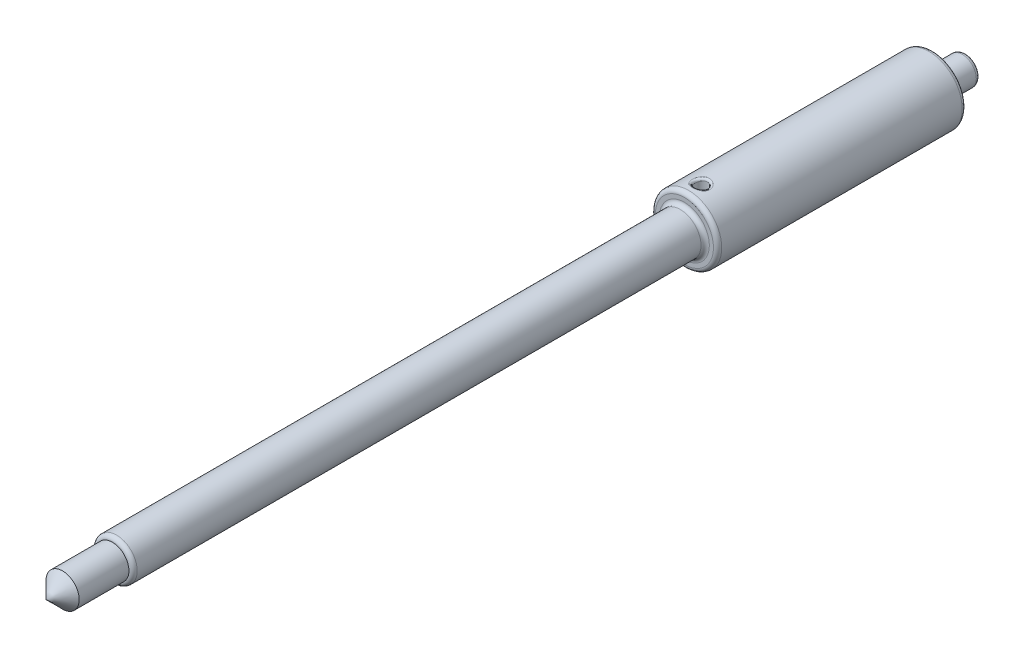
ISO-10303-21;
HEADER;
FILE_DESCRIPTION(('STEP AP214'),'2;1');
FILE_NAME('part.step','',(''),(''),'','','');
FILE_SCHEMA(('AUTOMOTIVE_DESIGN { 1 0 10303 214 1 1 1 1 }'));
ENDSEC;
DATA;
#1=APPLICATION_CONTEXT('core data for automotive mechanical design processes');
#2=APPLICATION_PROTOCOL_DEFINITION('international standard','automotive_design',2000,#1);
#3=PRODUCT_CONTEXT('',#1,'mechanical');
#4=PRODUCT('Part','Part','',(#3));
#5=PRODUCT_RELATED_PRODUCT_CATEGORY('part','',(#4));
#6=PRODUCT_DEFINITION_FORMATION('','',#4);
#7=PRODUCT_DEFINITION_CONTEXT('part definition',#1,'design');
#8=PRODUCT_DEFINITION('design','',#6,#7);
#9=PRODUCT_DEFINITION_SHAPE('','',#8);
#10=(LENGTH_UNIT() NAMED_UNIT(*) SI_UNIT(.MILLI.,.METRE.));
#11=(NAMED_UNIT(*) PLANE_ANGLE_UNIT() SI_UNIT($,.RADIAN.));
#12=(NAMED_UNIT(*) SI_UNIT($,.STERADIAN.) SOLID_ANGLE_UNIT());
#13=UNCERTAINTY_MEASURE_WITH_UNIT(LENGTH_MEASURE(1.E-05),#10,'distance_accuracy_value','');
#14=(GEOMETRIC_REPRESENTATION_CONTEXT(3) GLOBAL_UNCERTAINTY_ASSIGNED_CONTEXT((#13)) GLOBAL_UNIT_ASSIGNED_CONTEXT((#10,
#11,#12)) REPRESENTATION_CONTEXT('',''));
#15=CARTESIAN_POINT('',(0.,0.,0.));
#16=DIRECTION('',(0.,0.,1.));
#17=DIRECTION('',(1.,0.,0.));
#18=AXIS2_PLACEMENT_3D('',#15,#16,#17);
#19=CARTESIAN_POINT('',(0.,0.,53.5));
#20=DIRECTION('',(0.,0.,-1.));
#21=DIRECTION('',(-1.,0.,0.));
#22=AXIS2_PLACEMENT_3D('',#19,#20,#21);
#23=CONICAL_SURFACE('',#22,2.,0.785398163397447);
#24=CARTESIAN_POINT('',(0.,0.,55.5));
#25=VERTEX_POINT('',#24);
#26=VERTEX_LOOP('',#25);
#27=FACE_BOUND('',#26,.T.);
#28=CARTESIAN_POINT('',(0.,0.,53.5));
#29=DIRECTION('',(0.,0.,1.));
#30=DIRECTION('',(1.,0.,0.));
#31=AXIS2_PLACEMENT_3D('',#28,#29,#30);
#32=CIRCLE('',#31,2.);
#33=CARTESIAN_POINT('',(2.,0.,53.5));
#34=VERTEX_POINT('',#33);
#35=EDGE_CURVE('E47',#34,#34,#32,.T.);
#36=ORIENTED_EDGE('',*,*,#35,.T.);
#37=EDGE_LOOP('',(#36));
#38=FACE_BOUND('',#37,.T.);
#39=ADVANCED_FACE('F31',(#27,#38),#23,.T.);
#40=CARTESIAN_POINT('',(0.,0.,55.5));
#41=DIRECTION('',(0.,0.,1.));
#42=DIRECTION('',(1.,0.,0.));
#43=AXIS2_PLACEMENT_3D('',#40,#41,#42);
#44=CYLINDRICAL_SURFACE('',#43,2.);
#45=ORIENTED_EDGE('',*,*,#35,.F.);
#46=EDGE_LOOP('',(#45));
#47=FACE_BOUND('',#46,.T.);
#48=CARTESIAN_POINT('',(0.,0.,47.5));
#49=DIRECTION('',(0.,0.,1.));
#50=DIRECTION('',(1.,0.,0.));
#51=AXIS2_PLACEMENT_3D('',#48,#49,#50);
#52=CIRCLE('',#51,2.);
#53=CARTESIAN_POINT('',(2.,0.,47.5));
#54=VERTEX_POINT('',#53);
#55=EDGE_CURVE('E50',#54,#54,#52,.T.);
#56=ORIENTED_EDGE('',*,*,#55,.T.);
#57=EDGE_LOOP('',(#56));
#58=FACE_BOUND('',#57,.T.);
#59=ADVANCED_FACE('F43',(#47,#58),#44,.T.);
#60=CARTESIAN_POINT('',(0.,0.,55.5));
#61=DIRECTION('',(0.,0.,1.));
#62=DIRECTION('',(1.,0.,0.));
#63=AXIS2_PLACEMENT_3D('',#60,#61,#62);
#64=CYLINDRICAL_SURFACE('',#63,2.5);
#65=CARTESIAN_POINT('',(0.,0.,-21.));
#66=DIRECTION('',(0.,0.,-1.));
#67=DIRECTION('',(-1.,0.,0.));
#68=AXIS2_PLACEMENT_3D('',#65,#66,#67);
#69=CIRCLE('',#68,2.5);
#70=CARTESIAN_POINT('',(-2.5,0.,-21.));
#71=VERTEX_POINT('',#70);
#72=EDGE_CURVE('E11',#71,#71,#69,.F.);
#73=ORIENTED_EDGE('',*,*,#72,.T.);
#74=EDGE_LOOP('',(#73));
#75=FACE_BOUND('',#74,.T.);
#76=CARTESIAN_POINT('',(0.,0.,47.));
#77=DIRECTION('',(0.,0.,-1.));
#78=DIRECTION('',(-1.,0.,0.));
#79=AXIS2_PLACEMENT_3D('',#76,#77,#78);
#80=CIRCLE('',#79,2.5);
#81=CARTESIAN_POINT('',(-2.5,0.,47.));
#82=VERTEX_POINT('',#81);
#83=EDGE_CURVE('E38',#82,#82,#80,.T.);
#84=ORIENTED_EDGE('',*,*,#83,.T.);
#85=EDGE_LOOP('',(#84));
#86=FACE_BOUND('',#85,.T.);
#87=ADVANCED_FACE('F134',(#75,#86),#64,.T.);
#88=CARTESIAN_POINT('',(0.,2.5,-21.5));
#89=DIRECTION('',(0.,0.,-1.));
#90=DIRECTION('',(-1.,0.,0.));
#91=AXIS2_PLACEMENT_3D('',#88,#89,#90);
#92=PLANE('',#91);
#93=CARTESIAN_POINT('',(0.,0.,-21.5));
#94=DIRECTION('',(0.,0.,-1.));
#95=DIRECTION('',(-1.,0.,0.));
#96=AXIS2_PLACEMENT_3D('',#93,#94,#95);
#97=CIRCLE('',#96,3.5);
#98=CARTESIAN_POINT('',(-3.5,0.,-21.5));
#99=VERTEX_POINT('',#98);
#100=EDGE_CURVE('E141',#99,#99,#97,.F.);
#101=ORIENTED_EDGE('',*,*,#100,.T.);
#102=EDGE_LOOP('',(#101));
#103=FACE_BOUND('',#102,.T.);
#104=CARTESIAN_POINT('',(0.,0.,-21.5));
#105=DIRECTION('',(0.,0.,-1.));
#106=DIRECTION('',(-1.,0.,0.));
#107=AXIS2_PLACEMENT_3D('',#104,#105,#106);
#108=CIRCLE('',#107,3.);
#109=CARTESIAN_POINT('',(-3.,0.,-21.5));
#110=VERTEX_POINT('',#109);
#111=EDGE_CURVE('E131',#110,#110,#108,.T.);
#112=ORIENTED_EDGE('',*,*,#111,.T.);
#113=EDGE_LOOP('',(#112));
#114=FACE_BOUND('',#113,.T.);
#115=ADVANCED_FACE('F137',(#103,#114),#92,.F.);
#116=CARTESIAN_POINT('',(0.,0.,55.5));
#117=DIRECTION('',(0.,0.,1.));
#118=DIRECTION('',(1.,0.,0.));
#119=AXIS2_PLACEMENT_3D('',#116,#117,#118);
#120=CYLINDRICAL_SURFACE('',#119,4.);
#121=CARTESIAN_POINT('',(0.,0.,-51.));
#122=DIRECTION('',(0.,0.,1.));
#123=DIRECTION('',(1.,0.,0.));
#124=AXIS2_PLACEMENT_3D('',#121,#122,#123);
#125=CIRCLE('',#124,4.);
#126=CARTESIAN_POINT('',(4.,0.,-51.));
#127=VERTEX_POINT('',#126);
#128=EDGE_CURVE('E146',#127,#127,#125,.T.);
#129=ORIENTED_EDGE('',*,*,#128,.T.);
#130=EDGE_LOOP('',(#129));
#131=FACE_BOUND('',#130,.T.);
#132=CARTESIAN_POINT('',(0.,0.,-22.));
#133=DIRECTION('',(0.,0.,-1.));
#134=DIRECTION('',(-1.,0.,0.));
#135=AXIS2_PLACEMENT_3D('',#132,#133,#134);
#136=CIRCLE('',#135,4.);
#137=CARTESIAN_POINT('',(-4.,0.,-22.));
#138=VERTEX_POINT('',#137);
#139=EDGE_CURVE('E149',#138,#138,#136,.T.);
#140=ORIENTED_EDGE('',*,*,#139,.T.);
#141=EDGE_LOOP('',(#140));
#142=FACE_BOUND('',#141,.T.);
#143=CARTESIAN_POINT('',(-0.195879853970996,-3.74089408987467,-22.7760310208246));
#144=CARTESIAN_POINT('',(-0.212404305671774,-3.99490745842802,-22.7805019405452));
#145=CARTESIAN_POINT('',(-0.278584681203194,-3.99028702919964,-22.5347080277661));
#146=CARTESIAN_POINT('',(-0.155399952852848,-3.74466208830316,-22.7650786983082));
#147=CARTESIAN_POINT('',(-0.169050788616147,-3.99697783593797,-22.7677849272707));
#148=CARTESIAN_POINT('',(-0.221013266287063,-3.99430622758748,-22.5201049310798));
#149=CARTESIAN_POINT('',(-0.113944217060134,-3.7473366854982,-22.7575158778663));
#150=CARTESIAN_POINT('',(-0.124016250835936,-3.99849396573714,-22.758848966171));
#151=CARTESIAN_POINT('',(-0.162053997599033,-3.99715913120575,-22.510021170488));
#152=CARTESIAN_POINT('',(-0.030306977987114,-3.75019672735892,-22.749436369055));
#153=CARTESIAN_POINT('',(-0.0331003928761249,-4.00010842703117,-22.7493473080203));
#154=CARTESIAN_POINT('',(-0.0431032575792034,-4.00020984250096,-22.4992484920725));
#155=CARTESIAN_POINT('',(0.0118743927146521,-3.75038262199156,-22.7489184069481));
#156=CARTESIAN_POINT('',(0.013004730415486,-4.00021509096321,-22.7487324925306));
#157=CARTESIAN_POINT('',(0.0168880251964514,-4.00040813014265,-22.4985578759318));
#158=CARTESIAN_POINT('',(0.0945300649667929,-3.74827555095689,-22.7548598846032));
#159=CARTESIAN_POINT('',(0.102917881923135,-3.99902399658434,-22.7557232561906));
#160=CARTESIAN_POINT('',(0.134442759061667,-3.99816058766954,-22.5064798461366));
#161=CARTESIAN_POINT('',(0.135019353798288,-3.74605084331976,-22.7611271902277));
#162=CARTESIAN_POINT('',(0.146968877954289,-3.99775924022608,-22.7631357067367));
#163=CARTESIAN_POINT('',(0.192027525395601,-3.99578756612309,-22.5148362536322));
#164=CARTESIAN_POINT('',(0.214398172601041,-3.73946493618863,-22.7801379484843));
#165=CARTESIAN_POINT('',(0.232539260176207,-3.99410591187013,-22.7853428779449));
#166=CARTESIAN_POINT('',(0.304921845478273,-3.98876259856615,-22.5401839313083));
#167=CARTESIAN_POINT('',(0.253285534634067,-3.73510093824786,-22.7928898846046));
#168=CARTESIAN_POINT('',(0.274226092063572,-3.99170026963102,-22.8002457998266));
#169=CARTESIAN_POINT('',(0.360228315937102,-3.98410766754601,-22.5571865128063));
#170=CARTESIAN_POINT('',(0.328596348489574,-3.72466236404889,-22.8245713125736));
#171=CARTESIAN_POINT('',(0.353862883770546,-3.98614158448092,-22.8366787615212));
#172=CARTESIAN_POINT('',(0.467337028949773,-3.97297318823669,-22.5994284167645));
#173=CARTESIAN_POINT('',(0.365003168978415,-3.71857742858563,-22.8435383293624));
#174=CARTESIAN_POINT('',(0.391888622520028,-3.98296585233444,-22.8583873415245));
#175=CARTESIAN_POINT('',(0.51911561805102,-3.96648259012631,-22.6247177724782));
#176=CARTESIAN_POINT('',(0.434171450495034,-3.70534126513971,-22.8870838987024));
#177=CARTESIAN_POINT('',(0.462828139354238,-3.97636582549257,-22.9072327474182));
#178=CARTESIAN_POINT('',(0.61748828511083,-3.95236401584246,-22.6827785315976));
#179=CARTESIAN_POINT('',(0.466932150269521,-3.69818981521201,-22.911663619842));
#180=CARTESIAN_POINT('',(0.49575751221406,-3.97292950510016,-22.9345109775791));
#181=CARTESIAN_POINT('',(0.664081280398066,-3.94473580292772,-22.7155514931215));
#182=CARTESIAN_POINT('',(0.52896518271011,-3.68332638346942,-22.9666456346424));
#183=CARTESIAN_POINT('',(0.5567417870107,-3.9661826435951,-22.9940975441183));
#184=CARTESIAN_POINT('',(0.752306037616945,-3.92888147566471,-22.7888608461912));
#185=CARTESIAN_POINT('',(0.55809564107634,-3.67560385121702,-22.9972065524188));
#186=CARTESIAN_POINT('',(0.584524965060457,-3.96288155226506,-23.0266285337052));
#187=CARTESIAN_POINT('',(0.793736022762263,-3.92064410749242,-22.8296087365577));
#188=CARTESIAN_POINT('',(0.610818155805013,-3.66067016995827,-23.0627718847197));
#189=CARTESIAN_POINT('',(0.633506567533,-3.95693163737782,-23.0944882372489));
#190=CARTESIAN_POINT('',(0.868719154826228,-3.90471484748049,-22.9170291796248));
#191=CARTESIAN_POINT('',(0.634417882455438,-3.65345832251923,-23.0977700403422));
#192=CARTESIAN_POINT('',(0.654578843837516,-3.95429573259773,-23.129836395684));
#193=CARTESIAN_POINT('',(0.902283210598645,-3.89702221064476,-22.9636933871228));
#194=CARTESIAN_POINT('',(0.675678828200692,-3.64028593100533,-23.1717186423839));
#195=CARTESIAN_POINT('',(0.690479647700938,-3.94983394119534,-23.2024184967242));
#196=CARTESIAN_POINT('',(0.960965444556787,-3.88297165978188,-23.0622915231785));
#197=CARTESIAN_POINT('',(0.693276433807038,-3.63433902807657,-23.2107060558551));
#198=CARTESIAN_POINT('',(0.705077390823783,-3.94803765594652,-23.2395776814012));
#199=CARTESIAN_POINT('',(0.985993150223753,-3.87662829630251,-23.1142747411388));
#200=CARTESIAN_POINT('',(0.721621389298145,-3.62451783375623,-23.2912335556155));
#201=CARTESIAN_POINT('',(0.728143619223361,-3.94526174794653,-23.3144731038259));
#202=CARTESIAN_POINT('',(1.02630597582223,-3.8661523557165,-23.2216447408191));
#203=CARTESIAN_POINT('',(0.732370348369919,-3.62064305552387,-23.3327730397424));
#204=CARTESIAN_POINT('',(0.736477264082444,-3.94429932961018,-23.3520246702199));
#205=CARTESIAN_POINT('',(1.04159338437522,-3.86201925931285,-23.2770307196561));
#206=CARTESIAN_POINT('',(0.746437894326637,-3.61553164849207,-23.415974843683));
#207=CARTESIAN_POINT('',(0.747345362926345,-3.94306175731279,-23.426271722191));
#208=CARTESIAN_POINT('',(1.06160056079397,-3.85656709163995,-23.3879664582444));
#209=CARTESIAN_POINT('',(0.749957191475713,-3.61422380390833,-23.4576007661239));
#210=CARTESIAN_POINT('',(0.749967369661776,-3.94277605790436,-23.4627358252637));
#211=CARTESIAN_POINT('',(1.0666057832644,-3.85517205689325,-23.4434676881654));
#212=CARTESIAN_POINT('',(0.750042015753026,-3.61419263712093,-23.5408570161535));
#213=CARTESIAN_POINT('',(0.75003203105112,-3.94276889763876,-23.535910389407));
#214=CARTESIAN_POINT('',(1.06672642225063,-3.85513881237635,-23.5544760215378));
#215=CARTESIAN_POINT('',(0.746608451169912,-3.61546897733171,-23.5824873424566));
#216=CARTESIAN_POINT('',(0.747474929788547,-3.94304741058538,-23.5723722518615));
#217=CARTESIAN_POINT('',(1.0618431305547,-3.85650024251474,-23.6099831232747));
#218=CARTESIAN_POINT('',(0.733071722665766,-3.62038885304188,-23.6635765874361));
#219=CARTESIAN_POINT('',(0.737018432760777,-3.94423737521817,-23.644717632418));
#220=CARTESIAN_POINT('',(1.04259089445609,-3.86174810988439,-23.7181021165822));
#221=CARTESIAN_POINT('',(0.72312319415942,-3.62397747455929,-23.703063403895));
#222=CARTESIAN_POINT('',(0.729307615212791,-3.9451266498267,-23.6803734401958));
#223=CARTESIAN_POINT('',(1.02844187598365,-3.86557597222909,-23.770751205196));
#224=CARTESIAN_POINT('',(0.697010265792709,-3.63306152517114,-23.7798661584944));
#225=CARTESIAN_POINT('',(0.708142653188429,-3.94766499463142,-23.7515814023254));
#226=CARTESIAN_POINT('',(0.99130348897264,-3.87526562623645,-23.8731548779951));
#227=CARTESIAN_POINT('',(0.680834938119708,-3.63856030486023,-23.8171781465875));
#228=CARTESIAN_POINT('',(0.694792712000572,-3.94930088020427,-23.7869710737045));
#229=CARTESIAN_POINT('',(0.968298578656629,-3.88113099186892,-23.9229041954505));
#230=CARTESIAN_POINT('',(0.64239529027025,-3.65096787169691,-23.8892652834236));
#231=CARTESIAN_POINT('',(0.661610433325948,-3.95341987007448,-23.8572744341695));
#232=CARTESIAN_POINT('',(0.9136288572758,-3.89436572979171,-24.0190203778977));
#233=CARTESIAN_POINT('',(0.620024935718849,-3.65790062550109,-23.9239814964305));
#234=CARTESIAN_POINT('',(0.641804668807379,-3.95589980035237,-23.8920902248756));
#235=CARTESIAN_POINT('',(0.881813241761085,-3.90176066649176,-24.0653086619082));
#236=CARTESIAN_POINT('',(0.569941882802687,-3.67235375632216,-23.9892429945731));
#237=CARTESIAN_POINT('',(0.595666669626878,-3.96154309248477,-23.9591749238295));
#238=CARTESIAN_POINT('',(0.810584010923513,-3.91717733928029,-24.1523239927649));
#239=CARTESIAN_POINT('',(0.542228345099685,-3.67987422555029,-24.0197876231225));
#240=CARTESIAN_POINT('',(0.569465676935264,-3.96469230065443,-23.9914520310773));
#241=CARTESIAN_POINT('',(0.771169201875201,-3.92519917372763,-24.1930501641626));
#242=CARTESIAN_POINT('',(0.481235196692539,-3.69493553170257,-24.0768089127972));
#243=CARTESIAN_POINT('',(0.510014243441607,-3.97140268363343,-24.0528141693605));
#244=CARTESIAN_POINT('',(0.684423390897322,-3.94126456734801,-24.2690785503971));
#245=CARTESIAN_POINT('',(0.447810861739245,-3.702469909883,-24.1031319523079));
#246=CARTESIAN_POINT('',(0.476640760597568,-3.9749725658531,-24.0818848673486));
#247=CARTESIAN_POINT('',(0.636886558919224,-3.94930123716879,-24.3041759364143));
#248=CARTESIAN_POINT('',(0.376917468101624,-3.71647858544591,-24.1497938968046));
#249=CARTESIAN_POINT('',(0.404265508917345,-3.98188754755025,-24.1340283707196));
#250=CARTESIAN_POINT('',(0.536060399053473,-3.96424382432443,-24.3663918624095));
#251=CARTESIAN_POINT('',(0.339450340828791,-3.72295338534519,-24.1701356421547));
#252=CARTESIAN_POINT('',(0.365260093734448,-3.9852446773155,-24.1572578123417));
#253=CARTESIAN_POINT('',(0.482773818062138,-3.97115027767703,-24.3935141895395));
#254=CARTESIAN_POINT('',(0.266666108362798,-3.73338166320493,-24.201962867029));
#255=CARTESIAN_POINT('',(0.288408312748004,-3.99077642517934,-24.1938222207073));
#256=CARTESIAN_POINT('',(0.379258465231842,-3.98227377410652,-24.4359504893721));
#257=CARTESIAN_POINT('',(0.231721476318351,-3.73755549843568,-24.2142644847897));
#258=CARTESIAN_POINT('',(0.251068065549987,-3.99305951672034,-24.2081481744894));
#259=CARTESIAN_POINT('',(0.329559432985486,-3.98672586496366,-24.4523526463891));
#260=CARTESIAN_POINT('',(0.160318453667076,-3.7442065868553,-24.2335976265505));
#261=CARTESIAN_POINT('',(0.174301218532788,-3.99672860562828,-24.2306833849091));
#262=CARTESIAN_POINT('',(0.228008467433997,-3.99382035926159,-24.4781301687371));
#263=CARTESIAN_POINT('',(0.123860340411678,-3.74668414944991,-24.2406301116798));
#264=CARTESIAN_POINT('',(0.134755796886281,-3.99812715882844,-24.2389739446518));
#265=CARTESIAN_POINT('',(0.17615692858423,-3.99646309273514,-24.4875068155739));
#266=CARTESIAN_POINT('',(0.0462959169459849,-3.74988536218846,-24.2496928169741));
#267=CARTESIAN_POINT('',(0.0505181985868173,-3.99993065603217,-24.2496220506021));
#268=CARTESIAN_POINT('',(0.0658430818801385,-3.99987771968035,-24.4995904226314));
#269=CARTESIAN_POINT('',(0.00511071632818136,-3.75039221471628,-24.2511051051));
#270=CARTESIAN_POINT('',(0.0055187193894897,-4.0002215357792,-24.2512988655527));
#271=CARTESIAN_POINT('',(0.00726857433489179,-4.00041836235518,-24.501473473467));
#272=CARTESIAN_POINT('',(-0.0769211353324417,-3.7489965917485,-24.2471749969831));
#273=CARTESIAN_POINT('',(-0.0837638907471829,-3.99943171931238,-24.2466725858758));
#274=CARTESIAN_POINT('',(-0.109398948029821,-3.998929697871,-24.4962333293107));
#275=CARTESIAN_POINT('',(-0.11776767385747,-3.74709334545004,-24.2418304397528));
#276=CARTESIAN_POINT('',(-0.128261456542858,-3.99834675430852,-24.2403445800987));
#277=CARTESIAN_POINT('',(-0.167491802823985,-3.99689956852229,-24.4891072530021));
#278=CARTESIAN_POINT('',(-0.197886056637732,-3.7410884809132,-24.2245810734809));
#279=CARTESIAN_POINT('',(-0.214790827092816,-3.99500262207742,-24.220164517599));
#280=CARTESIAN_POINT('',(-0.281437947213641,-3.99049437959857,-24.4661080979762));
#281=CARTESIAN_POINT('',(-0.237160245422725,-3.73699027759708,-24.2126864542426));
#282=CARTESIAN_POINT('',(-0.25700712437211,-3.99273056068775,-24.206232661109));
#283=CARTESIAN_POINT('',(-0.33729457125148,-3.98612296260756,-24.4502486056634));
#284=CARTESIAN_POINT('',(-0.313191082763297,-3.72702573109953,-24.182703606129));
#285=CARTESIAN_POINT('',(-0.337670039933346,-3.98738685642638,-24.1716608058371));
#286=CARTESIAN_POINT('',(-0.445427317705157,-3.97549411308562,-24.4102714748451));
#287=CARTESIAN_POINT('',(-0.349944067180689,-3.72115687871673,-24.1646065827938));
#288=CARTESIAN_POINT('',(-0.376224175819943,-3.98429564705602,-24.1508760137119));
#289=CARTESIAN_POINT('',(-0.497698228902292,-3.96923400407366,-24.3861421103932));
#290=CARTESIAN_POINT('',(-0.42046932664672,-3.70816503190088,-24.1224301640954));
#291=CARTESIAN_POINT('',(-0.448923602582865,-3.97774649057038,-24.1033694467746));
#292=CARTESIAN_POINT('',(-0.598000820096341,-3.95537603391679,-24.3299068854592));
#293=CARTESIAN_POINT('',(-0.454187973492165,-3.70102437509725,-24.0982642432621));
#294=CARTESIAN_POINT('',(-0.483015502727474,-3.97427061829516,-24.0764201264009));
#295=CARTESIAN_POINT('',(-0.645956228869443,-3.94775933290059,-24.297685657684));
#296=CARTESIAN_POINT('',(-0.517163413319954,-3.68630429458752,-24.0447477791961));
#297=CARTESIAN_POINT('',(-0.545291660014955,-3.96749775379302,-24.018146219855));
#298=CARTESIAN_POINT('',(-0.735521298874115,-3.9320579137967,-24.226330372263));
#299=CARTESIAN_POINT('',(-0.546419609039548,-3.67872481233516,-24.0153965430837));
#300=CARTESIAN_POINT('',(-0.573417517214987,-3.96419935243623,-23.9867105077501));
#301=CARTESIAN_POINT('',(-0.777130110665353,-3.92397313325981,-24.1871953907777));
#302=CARTESIAN_POINT('',(-0.600476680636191,-3.66372462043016,-23.9513662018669));
#303=CARTESIAN_POINT('',(-0.624088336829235,-3.95809766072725,-23.9199550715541));
#304=CARTESIAN_POINT('',(-0.854011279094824,-3.90797292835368,-24.1018216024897));
#305=CARTESIAN_POINT('',(-0.625130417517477,-3.65631424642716,-23.9165612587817));
#306=CARTESIAN_POINT('',(-0.646311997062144,-3.95532474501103,-23.8845305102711));
#307=CARTESIAN_POINT('',(-0.889074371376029,-3.90006852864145,-24.055415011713));
#308=CARTESIAN_POINT('',(-0.668205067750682,-3.64274606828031,-23.8432303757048));
#309=CARTESIAN_POINT('',(-0.684124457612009,-3.95062263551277,-23.8120400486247));
#310=CARTESIAN_POINT('',(-0.950336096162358,-3.88559580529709,-23.9576405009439));
#311=CARTESIAN_POINT('',(-0.686635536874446,-3.63658634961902,-23.8047102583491));
#312=CARTESIAN_POINT('',(-0.699562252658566,-3.94871250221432,-23.7750461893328));
#313=CARTESIAN_POINT('',(-0.976548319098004,-3.87902543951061,-23.9062803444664));
#314=CARTESIAN_POINT('',(-0.716613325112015,-3.626289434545,-23.7252829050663));
#315=CARTESIAN_POINT('',(-0.724158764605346,-3.94573322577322,-23.7006832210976));
#316=CARTESIAN_POINT('',(-1.01918339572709,-3.86804206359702,-23.8003772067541));
#317=CARTESIAN_POINT('',(-0.728214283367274,-3.62213652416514,-23.6843971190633));
#318=CARTESIAN_POINT('',(-0.733228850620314,-3.9446752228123,-23.6634846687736));
#319=CARTESIAN_POINT('',(-1.03568253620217,-3.86361229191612,-23.745862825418));
#320=CARTESIAN_POINT('',(-0.744353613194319,-3.61630023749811,-23.6011616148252));
#321=CARTESIAN_POINT('',(-0.745771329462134,-3.94323642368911,-23.5888664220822));
#322=CARTESIAN_POINT('',(-1.05863624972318,-3.85738691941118,-23.6348821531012));
#323=CARTESIAN_POINT('',(-0.748893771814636,-3.61461623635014,-23.5588122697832));
#324=CARTESIAN_POINT('',(-0.749162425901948,-3.94286521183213,-23.5516833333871));
#325=CARTESIAN_POINT('',(-1.06509336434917,-3.85559065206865,-23.5784163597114));
#326=CARTESIAN_POINT('',(-0.75071802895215,-3.61394310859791,-23.4753395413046));
#327=CARTESIAN_POINT('',(-0.750544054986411,-3.94271217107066,-23.4782994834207));
#328=CARTESIAN_POINT('',(-1.06768786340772,-3.85487264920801,-23.4671193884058));
#329=CARTESIAN_POINT('',(-0.748235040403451,-3.61486747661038,-23.4342214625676));
#330=CARTESIAN_POINT('',(-0.748698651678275,-3.94291244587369,-23.4423475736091));
#331=CARTESIAN_POINT('',(-1.06415650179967,-3.85585864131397,-23.412295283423));
#332=CARTESIAN_POINT('',(-0.736598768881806,-3.61911327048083,-23.3530144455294));
#333=CARTESIAN_POINT('',(-0.739754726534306,-3.94392371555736,-23.3701755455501));
#334=CARTESIAN_POINT('',(-1.04760713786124,-3.86038748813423,-23.3040192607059));
#335=CARTESIAN_POINT('',(-0.727445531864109,-3.62243467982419,-23.3129255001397));
#336=CARTESIAN_POINT('',(-0.732712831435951,-3.94472821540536,-23.3341802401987));
#337=CARTESIAN_POINT('',(-1.03458920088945,-3.86393032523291,-23.2505673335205));
#338=CARTESIAN_POINT('',(-0.702842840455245,-3.63105798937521,-23.2351063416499));
#339=CARTESIAN_POINT('',(-0.712921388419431,-3.94708581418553,-23.2624646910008));
#340=CARTESIAN_POINT('',(-0.999598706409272,-3.87312852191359,-23.1468084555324));
#341=CARTESIAN_POINT('',(-0.687428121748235,-3.6363489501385,-23.1973644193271));
#342=CARTESIAN_POINT('',(-0.700313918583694,-3.94862087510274,-23.2269195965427));
#343=CARTESIAN_POINT('',(-0.977675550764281,-3.87877221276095,-23.096485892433));
#344=CARTESIAN_POINT('',(-0.650740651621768,-3.64832956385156,-23.1249156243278));
#345=CARTESIAN_POINT('',(-0.668909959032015,-3.9525103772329,-23.1567396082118));
#346=CARTESIAN_POINT('',(-0.925497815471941,-3.89155153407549,-22.9998874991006));
#347=CARTESIAN_POINT('',(-0.629459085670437,-3.65502131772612,-23.0902134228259));
#348=CARTESIAN_POINT('',(-0.650242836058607,-3.95484810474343,-23.1222010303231));
#349=CARTESIAN_POINT('',(-0.895230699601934,-3.89868940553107,-22.9536178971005));
#350=CARTESIAN_POINT('',(-0.580899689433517,-3.66929520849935,-23.023765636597));
#351=CARTESIAN_POINT('',(-0.605914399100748,-3.96030214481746,-23.0544027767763));
#352=CARTESIAN_POINT('',(-0.826168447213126,-3.91391488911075,-22.8650208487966));
#353=CARTESIAN_POINT('',(-0.553461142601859,-3.6768980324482,-22.9921399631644));
#354=CARTESIAN_POINT('',(-0.580189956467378,-3.96342517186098,-23.0212003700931));
#355=CARTESIAN_POINT('',(-0.787144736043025,-3.92202456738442,-22.8228532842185));
#356=CARTESIAN_POINT('',(-0.493705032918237,-3.69199369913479,-22.9338753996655));
#357=CARTESIAN_POINT('',(-0.522314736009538,-3.97005164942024,-22.9588223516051));
#358=CARTESIAN_POINT('',(-0.70215826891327,-3.93812661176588,-22.7451671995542));
#359=CARTESIAN_POINT('',(-0.461387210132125,-3.69948653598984,-22.9072367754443));
#360=CARTESIAN_POINT('',(-0.490254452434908,-3.97355067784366,-22.929561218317));
#361=CARTESIAN_POINT('',(-0.656195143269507,-3.94611897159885,-22.7096490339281));
#362=CARTESIAN_POINT('',(-0.392014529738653,-3.71369462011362,-22.8591886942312));
#363=CARTESIAN_POINT('',(-0.419839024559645,-3.98047785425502,-22.8761206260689));
#364=CARTESIAN_POINT('',(-0.557531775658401,-3.9612742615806,-22.6455849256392));
#365=CARTESIAN_POINT('',(-0.354879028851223,-3.72039168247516,-22.8378923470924));
#366=CARTESIAN_POINT('',(-0.381369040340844,-3.98391445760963,-22.8518946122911));
#367=CARTESIAN_POINT('',(-0.50471684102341,-3.96841779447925,-22.6171897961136));
#368=CARTESIAN_POINT('',(-0.277457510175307,-3.7320680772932,-22.8019052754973));
#369=CARTESIAN_POINT('',(-0.299981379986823,-3.99005442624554,-22.8107091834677));
#370=CARTESIAN_POINT('',(-0.394606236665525,-3.98087261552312,-22.5692070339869));
#371=CARTESIAN_POINT('',(-0.237176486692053,-3.73705006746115,-22.787204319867));
#372=CARTESIAN_POINT('',(-0.256975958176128,-3.99277890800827,-22.7935762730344));
#373=CARTESIAN_POINT('',(-0.337317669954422,-3.98618673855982,-22.5496057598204));
#374=CARTESIAN_POINT('',(-0.195879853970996,-3.74089408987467,-22.7760310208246));
#375=CARTESIAN_POINT('',(-0.212404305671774,-3.99490745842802,-22.7805019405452));
#376=CARTESIAN_POINT('',(-0.278584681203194,-3.99028702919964,-22.5347080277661));
#377=(BOUNDED_SURFACE() B_SPLINE_SURFACE(3,2,((#143,#144,#145),(#146,#147,#148),(#149,#150,
#151),(#152,#153,#154),(#155,#156,#157),(#158,#159,#160),(#161,#162,#163),(#164,#165,#166),
(#167,#168,#169),(#170,#171,#172),(#173,#174,#175),(#176,#177,#178),(#179,#180,#181),(#182,#183,
#184),(#185,#186,#187),(#188,#189,#190),(#191,#192,#193),(#194,#195,#196),(#197,#198,#199),
(#200,#201,#202),(#203,#204,#205),(#206,#207,#208),(#209,#210,#211),(#212,#213,#214),(#215,#216,
#217),(#218,#219,#220),(#221,#222,#223),(#224,#225,#226),(#227,#228,#229),(#230,#231,#232),
(#233,#234,#235),(#236,#237,#238),(#239,#240,#241),(#242,#243,#244),(#245,#246,#247),(#248,#249,
#250),(#251,#252,#253),(#254,#255,#256),(#257,#258,#259),(#260,#261,#262),(#263,#264,#265),
(#266,#267,#268),(#269,#270,#271),(#272,#273,#274),(#275,#276,#277),(#278,#279,#280),(#281,#282,
#283),(#284,#285,#286),(#287,#288,#289),(#290,#291,#292),(#293,#294,#295),(#296,#297,#298),
(#299,#300,#301),(#302,#303,#304),(#305,#306,#307),(#308,#309,#310),(#311,#312,#313),(#314,#315,
#316),(#317,#318,#319),(#320,#321,#322),(#323,#324,#325),(#326,#327,#328),(#329,#330,#331),
(#332,#333,#334),(#335,#336,#337),(#338,#339,#340),(#341,#342,#343),(#344,#345,#346),(#347,#348,
#349),(#350,#351,#352),(#353,#354,#355),(#356,#357,#358),(#359,#360,#361),(#362,#363,#364),
(#365,#366,#367),(#368,#369,#370),(#371,#372,#373),(#374,#375,#376)),.UNSPECIFIED.,.T.,.F.,
.F.) B_SPLINE_SURFACE_WITH_KNOTS((4,2,2,2,2,2,2,2,2,2,2,2,2,2,2,2,2,2,2,2,2,2,2,2,2,2,2,2,2,2,2,
2,2,2,2,2,2,2,4),(3,3),(0.,0.167913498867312,0.335796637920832,0.499047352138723,
0.662512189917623,0.8269827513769,0.991487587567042,1.16115902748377,1.33059374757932,
1.50177214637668,1.67291030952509,1.83922935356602,2.00552667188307,2.16801332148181,
2.33078643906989,2.49653897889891,2.662317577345,2.83318410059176,3.00396935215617,
3.15213502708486,3.30027366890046,3.46431263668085,3.62840408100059,3.79224096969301,
3.95631113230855,4.12286835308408,4.28944784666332,4.46067661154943,4.63164124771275,
4.80124456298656,4.97080494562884,5.13480865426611,5.29881123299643,5.46191616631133,
5.6252675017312,5.79351875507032,5.96177897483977,6.13334740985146,6.30464876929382),(0.,1.),
.UNSPECIFIED.) GEOMETRIC_REPRESENTATION_ITEM() RATIONAL_B_SPLINE_SURFACE(((1.,0.700646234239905,
1.),(1.,0.703328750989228,1.),(1.,0.705222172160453,1.),(1.,0.707246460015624,1.),(1.,
0.707377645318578,1.),(1.,0.705886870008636,1.),(1.,0.7043131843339,1.),(1.,0.699631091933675,
1.),(1.,0.696520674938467,1.),(1.,0.689027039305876,1.),(1.,0.68463610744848,1.),(1.,
0.674999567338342,1.),(1.,0.669753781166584,1.),(1.,0.658743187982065,1.),(1.,0.652967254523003,
1.),(1.,0.641684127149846,1.),(1.,0.636176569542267,1.),(1.,0.626028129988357,1.),(1.,
0.62139675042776,1.),(1.,0.613701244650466,1.),(1.,0.610636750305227,1.),(1.,0.606585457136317,
1.),(1.,0.605542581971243,1.),(1.,0.605517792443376,1.),(1.,0.60653560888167,1.),(1.,
0.610435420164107,1.),(1.,0.613274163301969,1.),(1.,0.620398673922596,1.),(1.,0.624686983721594,
1.),(1.,0.634266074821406,1.),(1.,0.639573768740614,1.),(1.,0.65052334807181,1.),(1.,
0.656165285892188,1.),(1.,0.667356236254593,1.),(1.,0.672897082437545,1.),(1.,0.683116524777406,
1.),(1.,0.687795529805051,1.),(1.,0.695289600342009,1.),(1.,0.698269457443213,1.),(1.,
0.703004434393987,1.),(1.,0.704759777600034,1.),(1.,0.707026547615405,1.),(1.,0.707384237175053,
1.),(1.,0.706397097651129,1.),(1.,0.705051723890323,1.),(1.,0.700786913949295,1.),(1.,
0.697869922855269,1.),(1.,0.690728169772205,1.),(1.,0.686501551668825,1.),(1.,0.677063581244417,
1.),(1.,0.671838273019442,1.),(1.,0.660959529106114,1.),(1.,0.655306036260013,1.),(1.,
0.644004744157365,1.),(1.,0.63836150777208,1.),(1.,0.627933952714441,1.),(1.,0.623148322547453,
1.),(1.,0.615095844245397,1.),(1.,0.611817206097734,1.),(1.,0.607196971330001,1.),(1.,
0.605854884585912,1.),(1.,0.605319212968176,1.),(1.,0.606056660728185,1.),(1.,0.609425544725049,
1.),(1.,0.612056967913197,1.),(1.,0.618831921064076,1.),(1.,0.622967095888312,1.),(1.,
0.632237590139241,1.),(1.,0.637374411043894,1.),(1.,0.64821819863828,1.),(1.,0.653937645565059,
1.),(1.,0.665181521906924,1.),(1.,0.670705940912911,1.),(1.,0.681095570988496,1.),(1.,
0.685945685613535,1.),(1.,0.694351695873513,1.),(1.,0.697909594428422,1.),(1.,0.700646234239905,1.))) REPRESENTATION_ITEM('') SURFACE());
#378=CARTESIAN_POINT('',(-0.278584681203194,-3.99028702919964,-22.5347080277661));
#379=CARTESIAN_POINT('',(-0.221013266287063,-3.99430622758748,-22.5201049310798));
#380=CARTESIAN_POINT('',(-0.162053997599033,-3.99715913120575,-22.5100211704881));
#381=CARTESIAN_POINT('',(-0.0431032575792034,-4.00020984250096,-22.4992484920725));
#382=CARTESIAN_POINT('',(0.0168880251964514,-4.00040813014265,-22.4985578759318));
#383=CARTESIAN_POINT('',(0.134442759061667,-3.99816058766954,-22.5064798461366));
#384=CARTESIAN_POINT('',(0.192027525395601,-3.99578756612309,-22.5148362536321));
#385=CARTESIAN_POINT('',(0.304921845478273,-3.98876259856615,-22.5401839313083));
#386=CARTESIAN_POINT('',(0.360228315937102,-3.98410766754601,-22.5571865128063));
#387=CARTESIAN_POINT('',(0.467337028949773,-3.97297318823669,-22.5994284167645));
#388=CARTESIAN_POINT('',(0.51911561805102,-3.96648259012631,-22.6247177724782));
#389=CARTESIAN_POINT('',(0.61748828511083,-3.95236401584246,-22.6827785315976));
#390=CARTESIAN_POINT('',(0.664081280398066,-3.94473580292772,-22.7155514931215));
#391=CARTESIAN_POINT('',(0.752306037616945,-3.92888147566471,-22.7888608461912));
#392=CARTESIAN_POINT('',(0.793736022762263,-3.92064410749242,-22.8296087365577));
#393=CARTESIAN_POINT('',(0.868719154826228,-3.90471484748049,-22.9170291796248));
#394=CARTESIAN_POINT('',(0.902283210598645,-3.89702221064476,-22.9636933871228));
#395=CARTESIAN_POINT('',(0.960965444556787,-3.88297165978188,-23.0622915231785));
#396=CARTESIAN_POINT('',(0.985993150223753,-3.87662829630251,-23.1142747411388));
#397=CARTESIAN_POINT('',(1.02630597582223,-3.8661523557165,-23.2216447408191));
#398=CARTESIAN_POINT('',(1.04159338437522,-3.86201925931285,-23.2770307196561));
#399=CARTESIAN_POINT('',(1.06160056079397,-3.85656709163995,-23.3879664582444));
#400=CARTESIAN_POINT('',(1.0666057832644,-3.85517205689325,-23.4434676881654));
#401=CARTESIAN_POINT('',(1.06672642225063,-3.85513881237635,-23.5544760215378));
#402=CARTESIAN_POINT('',(1.0618431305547,-3.85650024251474,-23.6099831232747));
#403=CARTESIAN_POINT('',(1.04259089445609,-3.86174810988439,-23.7181021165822));
#404=CARTESIAN_POINT('',(1.02844187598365,-3.86557597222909,-23.770751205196));
#405=CARTESIAN_POINT('',(0.99130348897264,-3.87526562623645,-23.8731548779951));
#406=CARTESIAN_POINT('',(0.968298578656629,-3.88113099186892,-23.9229041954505));
#407=CARTESIAN_POINT('',(0.9136288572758,-3.89436572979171,-24.0190203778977));
#408=CARTESIAN_POINT('',(0.881813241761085,-3.90176066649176,-24.0653086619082));
#409=CARTESIAN_POINT('',(0.810584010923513,-3.91717733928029,-24.1523239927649));
#410=CARTESIAN_POINT('',(0.771169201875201,-3.92519917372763,-24.1930501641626));
#411=CARTESIAN_POINT('',(0.684423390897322,-3.94126456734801,-24.2690785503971));
#412=CARTESIAN_POINT('',(0.636886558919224,-3.94930123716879,-24.3041759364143));
#413=CARTESIAN_POINT('',(0.536060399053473,-3.96424382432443,-24.3663918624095));
#414=CARTESIAN_POINT('',(0.482773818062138,-3.97115027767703,-24.3935141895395));
#415=CARTESIAN_POINT('',(0.379258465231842,-3.98227377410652,-24.4359504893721));
#416=CARTESIAN_POINT('',(0.329559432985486,-3.98672586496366,-24.4523526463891));
#417=CARTESIAN_POINT('',(0.228008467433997,-3.99382035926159,-24.4781301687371));
#418=CARTESIAN_POINT('',(0.17615692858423,-3.99646309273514,-24.4875068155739));
#419=CARTESIAN_POINT('',(0.0658430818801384,-3.99987771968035,-24.4995904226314));
#420=CARTESIAN_POINT('',(0.00726857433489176,-4.00041836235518,-24.501473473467));
#421=CARTESIAN_POINT('',(-0.109398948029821,-3.998929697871,-24.4962333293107));
#422=CARTESIAN_POINT('',(-0.167491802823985,-3.99689956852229,-24.4891072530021));
#423=CARTESIAN_POINT('',(-0.281437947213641,-3.99049437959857,-24.4661080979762));
#424=CARTESIAN_POINT('',(-0.337294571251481,-3.98612296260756,-24.4502486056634));
#425=CARTESIAN_POINT('',(-0.445427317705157,-3.97549411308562,-24.4102714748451));
#426=CARTESIAN_POINT('',(-0.497698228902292,-3.96923400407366,-24.3861421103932));
#427=CARTESIAN_POINT('',(-0.598000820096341,-3.95537603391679,-24.3299068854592));
#428=CARTESIAN_POINT('',(-0.645956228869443,-3.94775933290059,-24.297685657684));
#429=CARTESIAN_POINT('',(-0.735521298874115,-3.9320579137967,-24.226330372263));
#430=CARTESIAN_POINT('',(-0.777130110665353,-3.92397313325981,-24.1871953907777));
#431=CARTESIAN_POINT('',(-0.854011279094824,-3.90797292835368,-24.1018216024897));
#432=CARTESIAN_POINT('',(-0.889074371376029,-3.90006852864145,-24.055415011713));
#433=CARTESIAN_POINT('',(-0.950336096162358,-3.88559580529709,-23.9576405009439));
#434=CARTESIAN_POINT('',(-0.976548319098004,-3.87902543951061,-23.9062803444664));
#435=CARTESIAN_POINT('',(-1.01918339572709,-3.86804206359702,-23.8003772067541));
#436=CARTESIAN_POINT('',(-1.03568253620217,-3.86361229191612,-23.745862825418));
#437=CARTESIAN_POINT('',(-1.05863624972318,-3.85738691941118,-23.6348821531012));
#438=CARTESIAN_POINT('',(-1.06509336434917,-3.85559065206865,-23.5784163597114));
#439=CARTESIAN_POINT('',(-1.06768786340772,-3.85487264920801,-23.4671193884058));
#440=CARTESIAN_POINT('',(-1.06415650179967,-3.85585864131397,-23.412295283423));
#441=CARTESIAN_POINT('',(-1.04760713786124,-3.86038748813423,-23.3040192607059));
#442=CARTESIAN_POINT('',(-1.03458920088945,-3.86393032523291,-23.2505673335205));
#443=CARTESIAN_POINT('',(-0.999598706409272,-3.87312852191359,-23.1468084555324));
#444=CARTESIAN_POINT('',(-0.977675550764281,-3.87877221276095,-23.096485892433));
#445=CARTESIAN_POINT('',(-0.925497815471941,-3.89155153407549,-22.9998874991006));
#446=CARTESIAN_POINT('',(-0.895230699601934,-3.89868940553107,-22.9536178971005));
#447=CARTESIAN_POINT('',(-0.826168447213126,-3.91391488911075,-22.8650208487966));
#448=CARTESIAN_POINT('',(-0.787144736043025,-3.92202456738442,-22.8228532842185));
#449=CARTESIAN_POINT('',(-0.70215826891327,-3.93812661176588,-22.7451671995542));
#450=CARTESIAN_POINT('',(-0.656195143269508,-3.94611897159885,-22.7096490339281));
#451=CARTESIAN_POINT('',(-0.557531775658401,-3.9612742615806,-22.6455849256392));
#452=CARTESIAN_POINT('',(-0.50471684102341,-3.96841779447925,-22.6171897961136));
#453=CARTESIAN_POINT('',(-0.394606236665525,-3.98087261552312,-22.5692070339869));
#454=CARTESIAN_POINT('',(-0.337317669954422,-3.98618673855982,-22.5496057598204));
#455=CARTESIAN_POINT('',(-0.278584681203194,-3.99028702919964,-22.5347080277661));
#456=B_SPLINE_CURVE_WITH_KNOTS('',3,(#378,#379,#380,#381,#382,#383,#384,#385,#386,#387,#388,
#389,#390,#391,#392,#393,#394,#395,#396,#397,#398,#399,#400,#401,#402,#403,#404,#405,#406,#407,
#408,#409,#410,#411,#412,#413,#414,#415,#416,#417,#418,#419,#420,#421,#422,#423,#424,#425,#426,
#427,#428,#429,#430,#431,#432,#433,#434,#435,#436,#437,#438,#439,#440,#441,#442,#443,#444,#445,
#446,#447,#448,#449,#450,#451,#452,#453,#454,#455),.UNSPECIFIED.,.T.,.F.,(4,2,2,2,2,2,2,2,2,2,2,
2,2,2,2,2,2,2,2,2,2,2,2,2,2,2,2,2,2,2,2,2,2,2,2,2,2,2,4),(0.,0.167913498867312,
0.335796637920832,0.499047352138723,0.662512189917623,0.8269827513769,0.991487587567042,
1.16115902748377,1.33059374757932,1.50177214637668,1.67291030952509,1.83922935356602,
2.00552667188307,2.16801332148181,2.33078643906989,2.49653897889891,2.662317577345,
2.83318410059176,3.00396935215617,3.15213502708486,3.30027366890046,3.46431263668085,
3.62840408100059,3.79224096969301,3.95631113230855,4.12286835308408,4.28944784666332,
4.46067661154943,4.63164124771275,4.80124456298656,4.97080494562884,5.13480865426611,
5.29881123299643,5.46191616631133,5.6252675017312,5.79351875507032,5.96177897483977,
6.13334740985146,6.30464876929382),.UNSPECIFIED.);
#457=CARTESIAN_POINT('',(-0.278584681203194,-3.99028702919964,-22.5347080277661));
#458=VERTEX_POINT('',#457);
#459=EDGE_CURVE('E53',#458,#458,#456,.T.);
#460=ORIENTED_EDGE('',*,*,#459,.T.);
#461=EDGE_LOOP('',(#460));
#462=FACE_BOUND('',#461,.T.);
#463=CARTESIAN_POINT('',(0.195879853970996,3.74089408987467,-22.7760310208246));
#464=CARTESIAN_POINT('',(0.212404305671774,3.99490745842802,-22.7805019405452));
#465=CARTESIAN_POINT('',(0.278584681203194,3.99028702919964,-22.5347080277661));
#466=CARTESIAN_POINT('',(0.155399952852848,3.74466208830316,-22.7650786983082));
#467=CARTESIAN_POINT('',(0.169050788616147,3.99697783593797,-22.7677849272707));
#468=CARTESIAN_POINT('',(0.221013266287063,3.99430622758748,-22.5201049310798));
#469=CARTESIAN_POINT('',(0.113944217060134,3.7473366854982,-22.7575158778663));
#470=CARTESIAN_POINT('',(0.124016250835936,3.99849396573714,-22.758848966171));
#471=CARTESIAN_POINT('',(0.162053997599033,3.99715913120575,-22.510021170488));
#472=CARTESIAN_POINT('',(0.030306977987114,3.75019672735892,-22.749436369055));
#473=CARTESIAN_POINT('',(0.0331003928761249,4.00010842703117,-22.7493473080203));
#474=CARTESIAN_POINT('',(0.0431032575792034,4.00020984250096,-22.4992484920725));
#475=CARTESIAN_POINT('',(-0.0118743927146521,3.75038262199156,-22.7489184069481));
#476=CARTESIAN_POINT('',(-0.013004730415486,4.00021509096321,-22.7487324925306));
#477=CARTESIAN_POINT('',(-0.0168880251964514,4.00040813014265,-22.4985578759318));
#478=CARTESIAN_POINT('',(-0.0945300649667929,3.74827555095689,-22.7548598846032));
#479=CARTESIAN_POINT('',(-0.102917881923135,3.99902399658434,-22.7557232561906));
#480=CARTESIAN_POINT('',(-0.134442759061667,3.99816058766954,-22.5064798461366));
#481=CARTESIAN_POINT('',(-0.135019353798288,3.74605084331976,-22.7611271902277));
#482=CARTESIAN_POINT('',(-0.146968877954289,3.99775924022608,-22.7631357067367));
#483=CARTESIAN_POINT('',(-0.192027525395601,3.99578756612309,-22.5148362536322));
#484=CARTESIAN_POINT('',(-0.214398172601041,3.73946493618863,-22.7801379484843));
#485=CARTESIAN_POINT('',(-0.232539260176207,3.99410591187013,-22.7853428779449));
#486=CARTESIAN_POINT('',(-0.304921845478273,3.98876259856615,-22.5401839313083));
#487=CARTESIAN_POINT('',(-0.253285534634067,3.73510093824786,-22.7928898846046));
#488=CARTESIAN_POINT('',(-0.274226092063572,3.99170026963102,-22.8002457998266));
#489=CARTESIAN_POINT('',(-0.360228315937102,3.98410766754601,-22.5571865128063));
#490=CARTESIAN_POINT('',(-0.328596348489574,3.72466236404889,-22.8245713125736));
#491=CARTESIAN_POINT('',(-0.353862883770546,3.98614158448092,-22.8366787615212));
#492=CARTESIAN_POINT('',(-0.467337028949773,3.97297318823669,-22.5994284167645));
#493=CARTESIAN_POINT('',(-0.365003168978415,3.71857742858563,-22.8435383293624));
#494=CARTESIAN_POINT('',(-0.391888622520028,3.98296585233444,-22.8583873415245));
#495=CARTESIAN_POINT('',(-0.51911561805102,3.96648259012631,-22.6247177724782));
#496=CARTESIAN_POINT('',(-0.434171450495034,3.70534126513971,-22.8870838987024));
#497=CARTESIAN_POINT('',(-0.462828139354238,3.97636582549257,-22.9072327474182));
#498=CARTESIAN_POINT('',(-0.61748828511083,3.95236401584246,-22.6827785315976));
#499=CARTESIAN_POINT('',(-0.466932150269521,3.69818981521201,-22.911663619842));
#500=CARTESIAN_POINT('',(-0.49575751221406,3.97292950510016,-22.9345109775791));
#501=CARTESIAN_POINT('',(-0.664081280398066,3.94473580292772,-22.7155514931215));
#502=CARTESIAN_POINT('',(-0.52896518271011,3.68332638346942,-22.9666456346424));
#503=CARTESIAN_POINT('',(-0.5567417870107,3.9661826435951,-22.9940975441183));
#504=CARTESIAN_POINT('',(-0.752306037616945,3.92888147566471,-22.7888608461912));
#505=CARTESIAN_POINT('',(-0.55809564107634,3.67560385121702,-22.9972065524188));
#506=CARTESIAN_POINT('',(-0.584524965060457,3.96288155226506,-23.0266285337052));
#507=CARTESIAN_POINT('',(-0.793736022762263,3.92064410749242,-22.8296087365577));
#508=CARTESIAN_POINT('',(-0.610818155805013,3.66067016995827,-23.0627718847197));
#509=CARTESIAN_POINT('',(-0.633506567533,3.95693163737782,-23.0944882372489));
#510=CARTESIAN_POINT('',(-0.868719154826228,3.90471484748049,-22.9170291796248));
#511=CARTESIAN_POINT('',(-0.634417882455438,3.65345832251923,-23.0977700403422));
#512=CARTESIAN_POINT('',(-0.654578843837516,3.95429573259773,-23.129836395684));
#513=CARTESIAN_POINT('',(-0.902283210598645,3.89702221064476,-22.9636933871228));
#514=CARTESIAN_POINT('',(-0.675678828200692,3.64028593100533,-23.1717186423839));
#515=CARTESIAN_POINT('',(-0.690479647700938,3.94983394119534,-23.2024184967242));
#516=CARTESIAN_POINT('',(-0.960965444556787,3.88297165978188,-23.0622915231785));
#517=CARTESIAN_POINT('',(-0.693276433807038,3.63433902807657,-23.2107060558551));
#518=CARTESIAN_POINT('',(-0.705077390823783,3.94803765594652,-23.2395776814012));
#519=CARTESIAN_POINT('',(-0.985993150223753,3.87662829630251,-23.1142747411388));
#520=CARTESIAN_POINT('',(-0.721621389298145,3.62451783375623,-23.2912335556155));
#521=CARTESIAN_POINT('',(-0.728143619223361,3.94526174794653,-23.3144731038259));
#522=CARTESIAN_POINT('',(-1.02630597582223,3.8661523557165,-23.2216447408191));
#523=CARTESIAN_POINT('',(-0.732370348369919,3.62064305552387,-23.3327730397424));
#524=CARTESIAN_POINT('',(-0.736477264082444,3.94429932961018,-23.3520246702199));
#525=CARTESIAN_POINT('',(-1.04159338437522,3.86201925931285,-23.2770307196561));
#526=CARTESIAN_POINT('',(-0.746437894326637,3.61553164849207,-23.415974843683));
#527=CARTESIAN_POINT('',(-0.747345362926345,3.94306175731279,-23.426271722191));
#528=CARTESIAN_POINT('',(-1.06160056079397,3.85656709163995,-23.3879664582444));
#529=CARTESIAN_POINT('',(-0.749957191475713,3.61422380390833,-23.4576007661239));
#530=CARTESIAN_POINT('',(-0.749967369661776,3.94277605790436,-23.4627358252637));
#531=CARTESIAN_POINT('',(-1.0666057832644,3.85517205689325,-23.4434676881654));
#532=CARTESIAN_POINT('',(-0.750042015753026,3.61419263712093,-23.5408570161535));
#533=CARTESIAN_POINT('',(-0.75003203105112,3.94276889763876,-23.535910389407));
#534=CARTESIAN_POINT('',(-1.06672642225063,3.85513881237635,-23.5544760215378));
#535=CARTESIAN_POINT('',(-0.746608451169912,3.61546897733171,-23.5824873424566));
#536=CARTESIAN_POINT('',(-0.747474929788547,3.94304741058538,-23.5723722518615));
#537=CARTESIAN_POINT('',(-1.0618431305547,3.85650024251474,-23.6099831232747));
#538=CARTESIAN_POINT('',(-0.733071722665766,3.62038885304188,-23.6635765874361));
#539=CARTESIAN_POINT('',(-0.737018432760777,3.94423737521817,-23.644717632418));
#540=CARTESIAN_POINT('',(-1.04259089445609,3.86174810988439,-23.7181021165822));
#541=CARTESIAN_POINT('',(-0.72312319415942,3.62397747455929,-23.703063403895));
#542=CARTESIAN_POINT('',(-0.729307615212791,3.9451266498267,-23.6803734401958));
#543=CARTESIAN_POINT('',(-1.02844187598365,3.86557597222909,-23.770751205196));
#544=CARTESIAN_POINT('',(-0.697010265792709,3.63306152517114,-23.7798661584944));
#545=CARTESIAN_POINT('',(-0.708142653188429,3.94766499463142,-23.7515814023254));
#546=CARTESIAN_POINT('',(-0.99130348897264,3.87526562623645,-23.8731548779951));
#547=CARTESIAN_POINT('',(-0.680834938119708,3.63856030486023,-23.8171781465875));
#548=CARTESIAN_POINT('',(-0.694792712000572,3.94930088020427,-23.7869710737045));
#549=CARTESIAN_POINT('',(-0.968298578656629,3.88113099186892,-23.9229041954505));
#550=CARTESIAN_POINT('',(-0.64239529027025,3.65096787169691,-23.8892652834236));
#551=CARTESIAN_POINT('',(-0.661610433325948,3.95341987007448,-23.8572744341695));
#552=CARTESIAN_POINT('',(-0.9136288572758,3.89436572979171,-24.0190203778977));
#553=CARTESIAN_POINT('',(-0.620024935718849,3.65790062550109,-23.9239814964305));
#554=CARTESIAN_POINT('',(-0.641804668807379,3.95589980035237,-23.8920902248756));
#555=CARTESIAN_POINT('',(-0.881813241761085,3.90176066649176,-24.0653086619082));
#556=CARTESIAN_POINT('',(-0.569941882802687,3.67235375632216,-23.9892429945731));
#557=CARTESIAN_POINT('',(-0.595666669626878,3.96154309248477,-23.9591749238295));
#558=CARTESIAN_POINT('',(-0.810584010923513,3.91717733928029,-24.1523239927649));
#559=CARTESIAN_POINT('',(-0.542228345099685,3.67987422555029,-24.0197876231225));
#560=CARTESIAN_POINT('',(-0.569465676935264,3.96469230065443,-23.9914520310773));
#561=CARTESIAN_POINT('',(-0.771169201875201,3.92519917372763,-24.1930501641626));
#562=CARTESIAN_POINT('',(-0.481235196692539,3.69493553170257,-24.0768089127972));
#563=CARTESIAN_POINT('',(-0.510014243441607,3.97140268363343,-24.0528141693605));
#564=CARTESIAN_POINT('',(-0.684423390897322,3.94126456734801,-24.2690785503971));
#565=CARTESIAN_POINT('',(-0.447810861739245,3.702469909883,-24.1031319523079));
#566=CARTESIAN_POINT('',(-0.476640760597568,3.9749725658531,-24.0818848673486));
#567=CARTESIAN_POINT('',(-0.636886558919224,3.94930123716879,-24.3041759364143));
#568=CARTESIAN_POINT('',(-0.376917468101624,3.71647858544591,-24.1497938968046));
#569=CARTESIAN_POINT('',(-0.404265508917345,3.98188754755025,-24.1340283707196));
#570=CARTESIAN_POINT('',(-0.536060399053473,3.96424382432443,-24.3663918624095));
#571=CARTESIAN_POINT('',(-0.339450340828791,3.72295338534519,-24.1701356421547));
#572=CARTESIAN_POINT('',(-0.365260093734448,3.9852446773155,-24.1572578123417));
#573=CARTESIAN_POINT('',(-0.482773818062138,3.97115027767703,-24.3935141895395));
#574=CARTESIAN_POINT('',(-0.266666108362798,3.73338166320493,-24.201962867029));
#575=CARTESIAN_POINT('',(-0.288408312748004,3.99077642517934,-24.1938222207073));
#576=CARTESIAN_POINT('',(-0.379258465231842,3.98227377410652,-24.4359504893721));
#577=CARTESIAN_POINT('',(-0.231721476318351,3.73755549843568,-24.2142644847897));
#578=CARTESIAN_POINT('',(-0.251068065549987,3.99305951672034,-24.2081481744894));
#579=CARTESIAN_POINT('',(-0.329559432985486,3.98672586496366,-24.4523526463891));
#580=CARTESIAN_POINT('',(-0.160318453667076,3.7442065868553,-24.2335976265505));
#581=CARTESIAN_POINT('',(-0.174301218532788,3.99672860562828,-24.2306833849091));
#582=CARTESIAN_POINT('',(-0.228008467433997,3.99382035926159,-24.4781301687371));
#583=CARTESIAN_POINT('',(-0.123860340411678,3.74668414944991,-24.2406301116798));
#584=CARTESIAN_POINT('',(-0.134755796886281,3.99812715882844,-24.2389739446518));
#585=CARTESIAN_POINT('',(-0.17615692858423,3.99646309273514,-24.4875068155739));
#586=CARTESIAN_POINT('',(-0.0462959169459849,3.74988536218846,-24.2496928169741));
#587=CARTESIAN_POINT('',(-0.0505181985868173,3.99993065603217,-24.2496220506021));
#588=CARTESIAN_POINT('',(-0.0658430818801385,3.99987771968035,-24.4995904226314));
#589=CARTESIAN_POINT('',(-0.00511071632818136,3.75039221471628,-24.2511051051));
#590=CARTESIAN_POINT('',(-0.0055187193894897,4.0002215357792,-24.2512988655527));
#591=CARTESIAN_POINT('',(-0.00726857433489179,4.00041836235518,-24.501473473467));
#592=CARTESIAN_POINT('',(0.0769211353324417,3.7489965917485,-24.2471749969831));
#593=CARTESIAN_POINT('',(0.0837638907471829,3.99943171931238,-24.2466725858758));
#594=CARTESIAN_POINT('',(0.109398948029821,3.998929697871,-24.4962333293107));
#595=CARTESIAN_POINT('',(0.11776767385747,3.74709334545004,-24.2418304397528));
#596=CARTESIAN_POINT('',(0.128261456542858,3.99834675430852,-24.2403445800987));
#597=CARTESIAN_POINT('',(0.167491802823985,3.99689956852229,-24.4891072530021));
#598=CARTESIAN_POINT('',(0.197886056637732,3.7410884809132,-24.2245810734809));
#599=CARTESIAN_POINT('',(0.214790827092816,3.99500262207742,-24.220164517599));
#600=CARTESIAN_POINT('',(0.281437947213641,3.99049437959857,-24.4661080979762));
#601=CARTESIAN_POINT('',(0.237160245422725,3.73699027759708,-24.2126864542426));
#602=CARTESIAN_POINT('',(0.25700712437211,3.99273056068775,-24.206232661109));
#603=CARTESIAN_POINT('',(0.33729457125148,3.98612296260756,-24.4502486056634));
#604=CARTESIAN_POINT('',(0.313191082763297,3.72702573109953,-24.182703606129));
#605=CARTESIAN_POINT('',(0.337670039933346,3.98738685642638,-24.1716608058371));
#606=CARTESIAN_POINT('',(0.445427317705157,3.97549411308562,-24.4102714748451));
#607=CARTESIAN_POINT('',(0.349944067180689,3.72115687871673,-24.1646065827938));
#608=CARTESIAN_POINT('',(0.376224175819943,3.98429564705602,-24.1508760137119));
#609=CARTESIAN_POINT('',(0.497698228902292,3.96923400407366,-24.3861421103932));
#610=CARTESIAN_POINT('',(0.42046932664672,3.70816503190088,-24.1224301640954));
#611=CARTESIAN_POINT('',(0.448923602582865,3.97774649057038,-24.1033694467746));
#612=CARTESIAN_POINT('',(0.598000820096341,3.95537603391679,-24.3299068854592));
#613=CARTESIAN_POINT('',(0.454187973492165,3.70102437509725,-24.0982642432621));
#614=CARTESIAN_POINT('',(0.483015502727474,3.97427061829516,-24.0764201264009));
#615=CARTESIAN_POINT('',(0.645956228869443,3.94775933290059,-24.297685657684));
#616=CARTESIAN_POINT('',(0.517163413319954,3.68630429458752,-24.0447477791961));
#617=CARTESIAN_POINT('',(0.545291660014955,3.96749775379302,-24.018146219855));
#618=CARTESIAN_POINT('',(0.735521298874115,3.9320579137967,-24.226330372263));
#619=CARTESIAN_POINT('',(0.546419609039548,3.67872481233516,-24.0153965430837));
#620=CARTESIAN_POINT('',(0.573417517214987,3.96419935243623,-23.9867105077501));
#621=CARTESIAN_POINT('',(0.777130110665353,3.92397313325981,-24.1871953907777));
#622=CARTESIAN_POINT('',(0.600476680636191,3.66372462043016,-23.9513662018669));
#623=CARTESIAN_POINT('',(0.624088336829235,3.95809766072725,-23.9199550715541));
#624=CARTESIAN_POINT('',(0.854011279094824,3.90797292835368,-24.1018216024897));
#625=CARTESIAN_POINT('',(0.625130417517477,3.65631424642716,-23.9165612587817));
#626=CARTESIAN_POINT('',(0.646311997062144,3.95532474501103,-23.8845305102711));
#627=CARTESIAN_POINT('',(0.889074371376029,3.90006852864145,-24.055415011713));
#628=CARTESIAN_POINT('',(0.668205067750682,3.64274606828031,-23.8432303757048));
#629=CARTESIAN_POINT('',(0.684124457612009,3.95062263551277,-23.8120400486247));
#630=CARTESIAN_POINT('',(0.950336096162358,3.88559580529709,-23.9576405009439));
#631=CARTESIAN_POINT('',(0.686635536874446,3.63658634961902,-23.8047102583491));
#632=CARTESIAN_POINT('',(0.699562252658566,3.94871250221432,-23.7750461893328));
#633=CARTESIAN_POINT('',(0.976548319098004,3.87902543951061,-23.9062803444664));
#634=CARTESIAN_POINT('',(0.716613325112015,3.626289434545,-23.7252829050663));
#635=CARTESIAN_POINT('',(0.724158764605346,3.94573322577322,-23.7006832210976));
#636=CARTESIAN_POINT('',(1.01918339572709,3.86804206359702,-23.8003772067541));
#637=CARTESIAN_POINT('',(0.728214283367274,3.62213652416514,-23.6843971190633));
#638=CARTESIAN_POINT('',(0.733228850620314,3.9446752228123,-23.6634846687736));
#639=CARTESIAN_POINT('',(1.03568253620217,3.86361229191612,-23.745862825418));
#640=CARTESIAN_POINT('',(0.744353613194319,3.61630023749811,-23.6011616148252));
#641=CARTESIAN_POINT('',(0.745771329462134,3.94323642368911,-23.5888664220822));
#642=CARTESIAN_POINT('',(1.05863624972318,3.85738691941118,-23.6348821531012));
#643=CARTESIAN_POINT('',(0.748893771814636,3.61461623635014,-23.5588122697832));
#644=CARTESIAN_POINT('',(0.749162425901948,3.94286521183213,-23.5516833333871));
#645=CARTESIAN_POINT('',(1.06509336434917,3.85559065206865,-23.5784163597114));
#646=CARTESIAN_POINT('',(0.75071802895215,3.61394310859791,-23.4753395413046));
#647=CARTESIAN_POINT('',(0.750544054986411,3.94271217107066,-23.4782994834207));
#648=CARTESIAN_POINT('',(1.06768786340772,3.85487264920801,-23.4671193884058));
#649=CARTESIAN_POINT('',(0.748235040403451,3.61486747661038,-23.4342214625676));
#650=CARTESIAN_POINT('',(0.748698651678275,3.94291244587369,-23.4423475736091));
#651=CARTESIAN_POINT('',(1.06415650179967,3.85585864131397,-23.412295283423));
#652=CARTESIAN_POINT('',(0.736598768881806,3.61911327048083,-23.3530144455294));
#653=CARTESIAN_POINT('',(0.739754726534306,3.94392371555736,-23.3701755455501));
#654=CARTESIAN_POINT('',(1.04760713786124,3.86038748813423,-23.3040192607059));
#655=CARTESIAN_POINT('',(0.727445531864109,3.62243467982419,-23.3129255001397));
#656=CARTESIAN_POINT('',(0.732712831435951,3.94472821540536,-23.3341802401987));
#657=CARTESIAN_POINT('',(1.03458920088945,3.86393032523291,-23.2505673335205));
#658=CARTESIAN_POINT('',(0.702842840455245,3.63105798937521,-23.2351063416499));
#659=CARTESIAN_POINT('',(0.712921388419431,3.94708581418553,-23.2624646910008));
#660=CARTESIAN_POINT('',(0.999598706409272,3.87312852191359,-23.1468084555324));
#661=CARTESIAN_POINT('',(0.687428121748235,3.6363489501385,-23.1973644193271));
#662=CARTESIAN_POINT('',(0.700313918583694,3.94862087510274,-23.2269195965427));
#663=CARTESIAN_POINT('',(0.977675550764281,3.87877221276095,-23.096485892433));
#664=CARTESIAN_POINT('',(0.650740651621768,3.64832956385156,-23.1249156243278));
#665=CARTESIAN_POINT('',(0.668909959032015,3.9525103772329,-23.1567396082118));
#666=CARTESIAN_POINT('',(0.925497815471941,3.89155153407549,-22.9998874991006));
#667=CARTESIAN_POINT('',(0.629459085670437,3.65502131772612,-23.0902134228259));
#668=CARTESIAN_POINT('',(0.650242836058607,3.95484810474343,-23.1222010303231));
#669=CARTESIAN_POINT('',(0.895230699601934,3.89868940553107,-22.9536178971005));
#670=CARTESIAN_POINT('',(0.580899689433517,3.66929520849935,-23.023765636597));
#671=CARTESIAN_POINT('',(0.605914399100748,3.96030214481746,-23.0544027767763));
#672=CARTESIAN_POINT('',(0.826168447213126,3.91391488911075,-22.8650208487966));
#673=CARTESIAN_POINT('',(0.553461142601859,3.6768980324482,-22.9921399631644));
#674=CARTESIAN_POINT('',(0.580189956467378,3.96342517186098,-23.0212003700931));
#675=CARTESIAN_POINT('',(0.787144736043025,3.92202456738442,-22.8228532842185));
#676=CARTESIAN_POINT('',(0.493705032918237,3.69199369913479,-22.9338753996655));
#677=CARTESIAN_POINT('',(0.522314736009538,3.97005164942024,-22.9588223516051));
#678=CARTESIAN_POINT('',(0.70215826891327,3.93812661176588,-22.7451671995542));
#679=CARTESIAN_POINT('',(0.461387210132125,3.69948653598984,-22.9072367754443));
#680=CARTESIAN_POINT('',(0.490254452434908,3.97355067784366,-22.929561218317));
#681=CARTESIAN_POINT('',(0.656195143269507,3.94611897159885,-22.7096490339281));
#682=CARTESIAN_POINT('',(0.392014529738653,3.71369462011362,-22.8591886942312));
#683=CARTESIAN_POINT('',(0.419839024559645,3.98047785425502,-22.8761206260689));
#684=CARTESIAN_POINT('',(0.557531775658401,3.9612742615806,-22.6455849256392));
#685=CARTESIAN_POINT('',(0.354879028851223,3.72039168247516,-22.8378923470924));
#686=CARTESIAN_POINT('',(0.381369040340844,3.98391445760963,-22.8518946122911));
#687=CARTESIAN_POINT('',(0.50471684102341,3.96841779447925,-22.6171897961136));
#688=CARTESIAN_POINT('',(0.277457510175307,3.7320680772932,-22.8019052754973));
#689=CARTESIAN_POINT('',(0.299981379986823,3.99005442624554,-22.8107091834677));
#690=CARTESIAN_POINT('',(0.394606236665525,3.98087261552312,-22.5692070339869));
#691=CARTESIAN_POINT('',(0.237176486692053,3.73705006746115,-22.787204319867));
#692=CARTESIAN_POINT('',(0.256975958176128,3.99277890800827,-22.7935762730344));
#693=CARTESIAN_POINT('',(0.337317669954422,3.98618673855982,-22.5496057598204));
#694=CARTESIAN_POINT('',(0.195879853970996,3.74089408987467,-22.7760310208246));
#695=CARTESIAN_POINT('',(0.212404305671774,3.99490745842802,-22.7805019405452));
#696=CARTESIAN_POINT('',(0.278584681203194,3.99028702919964,-22.5347080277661));
#697=(BOUNDED_SURFACE() B_SPLINE_SURFACE(3,2,((#463,#464,#465),(#466,#467,#468),(#469,#470,
#471),(#472,#473,#474),(#475,#476,#477),(#478,#479,#480),(#481,#482,#483),(#484,#485,#486),
(#487,#488,#489),(#490,#491,#492),(#493,#494,#495),(#496,#497,#498),(#499,#500,#501),(#502,#503,
#504),(#505,#506,#507),(#508,#509,#510),(#511,#512,#513),(#514,#515,#516),(#517,#518,#519),
(#520,#521,#522),(#523,#524,#525),(#526,#527,#528),(#529,#530,#531),(#532,#533,#534),(#535,#536,
#537),(#538,#539,#540),(#541,#542,#543),(#544,#545,#546),(#547,#548,#549),(#550,#551,#552),
(#553,#554,#555),(#556,#557,#558),(#559,#560,#561),(#562,#563,#564),(#565,#566,#567),(#568,#569,
#570),(#571,#572,#573),(#574,#575,#576),(#577,#578,#579),(#580,#581,#582),(#583,#584,#585),
(#586,#587,#588),(#589,#590,#591),(#592,#593,#594),(#595,#596,#597),(#598,#599,#600),(#601,#602,
#603),(#604,#605,#606),(#607,#608,#609),(#610,#611,#612),(#613,#614,#615),(#616,#617,#618),
(#619,#620,#621),(#622,#623,#624),(#625,#626,#627),(#628,#629,#630),(#631,#632,#633),(#634,#635,
#636),(#637,#638,#639),(#640,#641,#642),(#643,#644,#645),(#646,#647,#648),(#649,#650,#651),
(#652,#653,#654),(#655,#656,#657),(#658,#659,#660),(#661,#662,#663),(#664,#665,#666),(#667,#668,
#669),(#670,#671,#672),(#673,#674,#675),(#676,#677,#678),(#679,#680,#681),(#682,#683,#684),
(#685,#686,#687),(#688,#689,#690),(#691,#692,#693),(#694,#695,#696)),.UNSPECIFIED.,.T.,.F.,
.F.) B_SPLINE_SURFACE_WITH_KNOTS((4,2,2,2,2,2,2,2,2,2,2,2,2,2,2,2,2,2,2,2,2,2,2,2,2,2,2,2,2,2,2,
2,2,2,2,2,2,2,4),(3,3),(0.,0.167913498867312,0.335796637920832,0.499047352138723,
0.662512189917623,0.8269827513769,0.991487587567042,1.16115902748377,1.33059374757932,
1.50177214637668,1.67291030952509,1.83922935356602,2.00552667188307,2.16801332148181,
2.33078643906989,2.49653897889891,2.662317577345,2.83318410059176,3.00396935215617,
3.15213502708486,3.30027366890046,3.46431263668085,3.62840408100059,3.79224096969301,
3.95631113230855,4.12286835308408,4.28944784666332,4.46067661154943,4.63164124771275,
4.80124456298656,4.97080494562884,5.13480865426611,5.29881123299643,5.46191616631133,
5.6252675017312,5.79351875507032,5.96177897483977,6.13334740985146,6.30464876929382),(0.,1.),
.UNSPECIFIED.) GEOMETRIC_REPRESENTATION_ITEM() RATIONAL_B_SPLINE_SURFACE(((1.,0.700646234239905,
1.),(1.,0.703328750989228,1.),(1.,0.705222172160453,1.),(1.,0.707246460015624,1.),(1.,
0.707377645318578,1.),(1.,0.705886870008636,1.),(1.,0.7043131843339,1.),(1.,0.699631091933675,
1.),(1.,0.696520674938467,1.),(1.,0.689027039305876,1.),(1.,0.68463610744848,1.),(1.,
0.674999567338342,1.),(1.,0.669753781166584,1.),(1.,0.658743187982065,1.),(1.,0.652967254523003,
1.),(1.,0.641684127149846,1.),(1.,0.636176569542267,1.),(1.,0.626028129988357,1.),(1.,
0.62139675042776,1.),(1.,0.613701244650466,1.),(1.,0.610636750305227,1.),(1.,0.606585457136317,
1.),(1.,0.605542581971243,1.),(1.,0.605517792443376,1.),(1.,0.60653560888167,1.),(1.,
0.610435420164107,1.),(1.,0.613274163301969,1.),(1.,0.620398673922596,1.),(1.,0.624686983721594,
1.),(1.,0.634266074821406,1.),(1.,0.639573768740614,1.),(1.,0.65052334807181,1.),(1.,
0.656165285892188,1.),(1.,0.667356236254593,1.),(1.,0.672897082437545,1.),(1.,0.683116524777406,
1.),(1.,0.687795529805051,1.),(1.,0.695289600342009,1.),(1.,0.698269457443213,1.),(1.,
0.703004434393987,1.),(1.,0.704759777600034,1.),(1.,0.707026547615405,1.),(1.,0.707384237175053,
1.),(1.,0.706397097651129,1.),(1.,0.705051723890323,1.),(1.,0.700786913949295,1.),(1.,
0.697869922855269,1.),(1.,0.690728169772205,1.),(1.,0.686501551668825,1.),(1.,0.677063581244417,
1.),(1.,0.671838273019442,1.),(1.,0.660959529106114,1.),(1.,0.655306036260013,1.),(1.,
0.644004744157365,1.),(1.,0.63836150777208,1.),(1.,0.627933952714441,1.),(1.,0.623148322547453,
1.),(1.,0.615095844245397,1.),(1.,0.611817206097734,1.),(1.,0.607196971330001,1.),(1.,
0.605854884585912,1.),(1.,0.605319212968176,1.),(1.,0.606056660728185,1.),(1.,0.609425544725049,
1.),(1.,0.612056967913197,1.),(1.,0.618831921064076,1.),(1.,0.622967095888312,1.),(1.,
0.632237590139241,1.),(1.,0.637374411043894,1.),(1.,0.64821819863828,1.),(1.,0.653937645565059,
1.),(1.,0.665181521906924,1.),(1.,0.670705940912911,1.),(1.,0.681095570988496,1.),(1.,
0.685945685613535,1.),(1.,0.694351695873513,1.),(1.,0.697909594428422,1.),(1.,0.700646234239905,1.))) REPRESENTATION_ITEM('') SURFACE());
#698=CARTESIAN_POINT('',(0.278584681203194,3.99028702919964,-22.5347080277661));
#699=CARTESIAN_POINT('',(0.221013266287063,3.99430622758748,-22.5201049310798));
#700=CARTESIAN_POINT('',(0.162053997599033,3.99715913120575,-22.5100211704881));
#701=CARTESIAN_POINT('',(0.0431032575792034,4.00020984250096,-22.4992484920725));
#702=CARTESIAN_POINT('',(-0.0168880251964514,4.00040813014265,-22.4985578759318));
#703=CARTESIAN_POINT('',(-0.134442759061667,3.99816058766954,-22.5064798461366));
#704=CARTESIAN_POINT('',(-0.192027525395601,3.99578756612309,-22.5148362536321));
#705=CARTESIAN_POINT('',(-0.304921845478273,3.98876259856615,-22.5401839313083));
#706=CARTESIAN_POINT('',(-0.360228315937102,3.98410766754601,-22.5571865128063));
#707=CARTESIAN_POINT('',(-0.467337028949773,3.97297318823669,-22.5994284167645));
#708=CARTESIAN_POINT('',(-0.51911561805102,3.96648259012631,-22.6247177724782));
#709=CARTESIAN_POINT('',(-0.61748828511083,3.95236401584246,-22.6827785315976));
#710=CARTESIAN_POINT('',(-0.664081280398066,3.94473580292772,-22.7155514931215));
#711=CARTESIAN_POINT('',(-0.752306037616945,3.92888147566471,-22.7888608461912));
#712=CARTESIAN_POINT('',(-0.793736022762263,3.92064410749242,-22.8296087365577));
#713=CARTESIAN_POINT('',(-0.868719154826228,3.90471484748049,-22.9170291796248));
#714=CARTESIAN_POINT('',(-0.902283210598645,3.89702221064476,-22.9636933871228));
#715=CARTESIAN_POINT('',(-0.960965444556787,3.88297165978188,-23.0622915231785));
#716=CARTESIAN_POINT('',(-0.985993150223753,3.87662829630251,-23.1142747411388));
#717=CARTESIAN_POINT('',(-1.02630597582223,3.8661523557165,-23.2216447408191));
#718=CARTESIAN_POINT('',(-1.04159338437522,3.86201925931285,-23.2770307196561));
#719=CARTESIAN_POINT('',(-1.06160056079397,3.85656709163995,-23.3879664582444));
#720=CARTESIAN_POINT('',(-1.0666057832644,3.85517205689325,-23.4434676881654));
#721=CARTESIAN_POINT('',(-1.06672642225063,3.85513881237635,-23.5544760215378));
#722=CARTESIAN_POINT('',(-1.0618431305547,3.85650024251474,-23.6099831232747));
#723=CARTESIAN_POINT('',(-1.04259089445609,3.86174810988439,-23.7181021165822));
#724=CARTESIAN_POINT('',(-1.02844187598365,3.86557597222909,-23.770751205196));
#725=CARTESIAN_POINT('',(-0.99130348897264,3.87526562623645,-23.8731548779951));
#726=CARTESIAN_POINT('',(-0.968298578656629,3.88113099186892,-23.9229041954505));
#727=CARTESIAN_POINT('',(-0.9136288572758,3.89436572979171,-24.0190203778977));
#728=CARTESIAN_POINT('',(-0.881813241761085,3.90176066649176,-24.0653086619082));
#729=CARTESIAN_POINT('',(-0.810584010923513,3.91717733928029,-24.1523239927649));
#730=CARTESIAN_POINT('',(-0.771169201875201,3.92519917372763,-24.1930501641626));
#731=CARTESIAN_POINT('',(-0.684423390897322,3.94126456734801,-24.2690785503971));
#732=CARTESIAN_POINT('',(-0.636886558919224,3.94930123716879,-24.3041759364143));
#733=CARTESIAN_POINT('',(-0.536060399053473,3.96424382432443,-24.3663918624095));
#734=CARTESIAN_POINT('',(-0.482773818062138,3.97115027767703,-24.3935141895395));
#735=CARTESIAN_POINT('',(-0.379258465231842,3.98227377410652,-24.4359504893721));
#736=CARTESIAN_POINT('',(-0.329559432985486,3.98672586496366,-24.4523526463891));
#737=CARTESIAN_POINT('',(-0.228008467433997,3.99382035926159,-24.4781301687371));
#738=CARTESIAN_POINT('',(-0.17615692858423,3.99646309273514,-24.4875068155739));
#739=CARTESIAN_POINT('',(-0.0658430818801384,3.99987771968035,-24.4995904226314));
#740=CARTESIAN_POINT('',(-0.00726857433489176,4.00041836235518,-24.501473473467));
#741=CARTESIAN_POINT('',(0.109398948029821,3.998929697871,-24.4962333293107));
#742=CARTESIAN_POINT('',(0.167491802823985,3.99689956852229,-24.4891072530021));
#743=CARTESIAN_POINT('',(0.281437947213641,3.99049437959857,-24.4661080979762));
#744=CARTESIAN_POINT('',(0.337294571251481,3.98612296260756,-24.4502486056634));
#745=CARTESIAN_POINT('',(0.445427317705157,3.97549411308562,-24.4102714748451));
#746=CARTESIAN_POINT('',(0.497698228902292,3.96923400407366,-24.3861421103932));
#747=CARTESIAN_POINT('',(0.598000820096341,3.95537603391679,-24.3299068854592));
#748=CARTESIAN_POINT('',(0.645956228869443,3.94775933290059,-24.297685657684));
#749=CARTESIAN_POINT('',(0.735521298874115,3.9320579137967,-24.226330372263));
#750=CARTESIAN_POINT('',(0.777130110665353,3.92397313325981,-24.1871953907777));
#751=CARTESIAN_POINT('',(0.854011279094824,3.90797292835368,-24.1018216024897));
#752=CARTESIAN_POINT('',(0.889074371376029,3.90006852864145,-24.055415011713));
#753=CARTESIAN_POINT('',(0.950336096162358,3.88559580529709,-23.9576405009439));
#754=CARTESIAN_POINT('',(0.976548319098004,3.87902543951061,-23.9062803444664));
#755=CARTESIAN_POINT('',(1.01918339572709,3.86804206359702,-23.8003772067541));
#756=CARTESIAN_POINT('',(1.03568253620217,3.86361229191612,-23.745862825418));
#757=CARTESIAN_POINT('',(1.05863624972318,3.85738691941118,-23.6348821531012));
#758=CARTESIAN_POINT('',(1.06509336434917,3.85559065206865,-23.5784163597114));
#759=CARTESIAN_POINT('',(1.06768786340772,3.85487264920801,-23.4671193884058));
#760=CARTESIAN_POINT('',(1.06415650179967,3.85585864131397,-23.412295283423));
#761=CARTESIAN_POINT('',(1.04760713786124,3.86038748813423,-23.3040192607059));
#762=CARTESIAN_POINT('',(1.03458920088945,3.86393032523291,-23.2505673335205));
#763=CARTESIAN_POINT('',(0.999598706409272,3.87312852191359,-23.1468084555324));
#764=CARTESIAN_POINT('',(0.977675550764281,3.87877221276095,-23.096485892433));
#765=CARTESIAN_POINT('',(0.925497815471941,3.89155153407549,-22.9998874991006));
#766=CARTESIAN_POINT('',(0.895230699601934,3.89868940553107,-22.9536178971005));
#767=CARTESIAN_POINT('',(0.826168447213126,3.91391488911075,-22.8650208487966));
#768=CARTESIAN_POINT('',(0.787144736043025,3.92202456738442,-22.8228532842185));
#769=CARTESIAN_POINT('',(0.70215826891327,3.93812661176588,-22.7451671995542));
#770=CARTESIAN_POINT('',(0.656195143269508,3.94611897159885,-22.7096490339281));
#771=CARTESIAN_POINT('',(0.557531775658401,3.9612742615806,-22.6455849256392));
#772=CARTESIAN_POINT('',(0.50471684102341,3.96841779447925,-22.6171897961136));
#773=CARTESIAN_POINT('',(0.394606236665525,3.98087261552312,-22.5692070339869));
#774=CARTESIAN_POINT('',(0.337317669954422,3.98618673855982,-22.5496057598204));
#775=CARTESIAN_POINT('',(0.278584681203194,3.99028702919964,-22.5347080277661));
#776=B_SPLINE_CURVE_WITH_KNOTS('',3,(#698,#699,#700,#701,#702,#703,#704,#705,#706,#707,#708,
#709,#710,#711,#712,#713,#714,#715,#716,#717,#718,#719,#720,#721,#722,#723,#724,#725,#726,#727,
#728,#729,#730,#731,#732,#733,#734,#735,#736,#737,#738,#739,#740,#741,#742,#743,#744,#745,#746,
#747,#748,#749,#750,#751,#752,#753,#754,#755,#756,#757,#758,#759,#760,#761,#762,#763,#764,#765,
#766,#767,#768,#769,#770,#771,#772,#773,#774,#775),.UNSPECIFIED.,.T.,.F.,(4,2,2,2,2,2,2,2,2,2,2,
2,2,2,2,2,2,2,2,2,2,2,2,2,2,2,2,2,2,2,2,2,2,2,2,2,2,2,4),(0.,0.167913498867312,
0.335796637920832,0.499047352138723,0.662512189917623,0.8269827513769,0.991487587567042,
1.16115902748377,1.33059374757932,1.50177214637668,1.67291030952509,1.83922935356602,
2.00552667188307,2.16801332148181,2.33078643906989,2.49653897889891,2.662317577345,
2.83318410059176,3.00396935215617,3.15213502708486,3.30027366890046,3.46431263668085,
3.62840408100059,3.79224096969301,3.95631113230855,4.12286835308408,4.28944784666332,
4.46067661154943,4.63164124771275,4.80124456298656,4.97080494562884,5.13480865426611,
5.29881123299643,5.46191616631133,5.6252675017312,5.79351875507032,5.96177897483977,
6.13334740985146,6.30464876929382),.UNSPECIFIED.);
#777=CARTESIAN_POINT('',(0.278584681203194,3.99028702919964,-22.5347080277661));
#778=VERTEX_POINT('',#777);
#779=EDGE_CURVE('E49',#778,#778,#776,.T.);
#780=ORIENTED_EDGE('',*,*,#779,.T.);
#781=EDGE_LOOP('',(#780));
#782=FACE_BOUND('',#781,.T.);
#783=ADVANCED_FACE('F66',(#131,#142,#462,#782),#120,.T.);
#784=CARTESIAN_POINT('',(0.,4.,-51.5));
#785=DIRECTION('',(0.,0.,1.));
#786=DIRECTION('',(1.,0.,0.));
#787=AXIS2_PLACEMENT_3D('',#784,#785,#786);
#788=PLANE('',#787);
#789=CARTESIAN_POINT('',(0.,0.,-51.5));
#790=DIRECTION('',(0.,0.,1.));
#791=DIRECTION('',(1.,0.,0.));
#792=AXIS2_PLACEMENT_3D('',#789,#790,#791);
#793=CIRCLE('',#792,2.2);
#794=CARTESIAN_POINT('',(2.2,0.,-51.5));
#795=VERTEX_POINT('',#794);
#796=EDGE_CURVE('E152',#795,#795,#793,.T.);
#797=ORIENTED_EDGE('',*,*,#796,.T.);
#798=EDGE_LOOP('',(#797));
#799=FACE_BOUND('',#798,.T.);
#800=CARTESIAN_POINT('',(0.,0.,-51.5));
#801=DIRECTION('',(0.,0.,1.));
#802=DIRECTION('',(1.,0.,0.));
#803=AXIS2_PLACEMENT_3D('',#800,#801,#802);
#804=CIRCLE('',#803,3.5);
#805=CARTESIAN_POINT('',(3.5,0.,-51.5));
#806=VERTEX_POINT('',#805);
#807=EDGE_CURVE('E155',#806,#806,#804,.F.);
#808=ORIENTED_EDGE('',*,*,#807,.T.);
#809=EDGE_LOOP('',(#808));
#810=FACE_BOUND('',#809,.T.);
#811=ADVANCED_FACE('F195',(#799,#810),#788,.F.);
#812=CARTESIAN_POINT('',(0.,0.,55.5));
#813=DIRECTION('',(0.,0.,1.));
#814=DIRECTION('',(1.,0.,0.));
#815=AXIS2_PLACEMENT_3D('',#812,#813,#814);
#816=CYLINDRICAL_SURFACE('',#815,1.7);
#817=CARTESIAN_POINT('',(0.,0.,-55.));
#818=DIRECTION('',(0.,0.,1.));
#819=DIRECTION('',(1.,0.,0.));
#820=AXIS2_PLACEMENT_3D('',#817,#818,#819);
#821=CIRCLE('',#820,1.7);
#822=CARTESIAN_POINT('',(1.7,0.,-55.));
#823=VERTEX_POINT('',#822);
#824=EDGE_CURVE('E160',#823,#823,#821,.T.);
#825=ORIENTED_EDGE('',*,*,#824,.T.);
#826=EDGE_LOOP('',(#825));
#827=FACE_BOUND('',#826,.T.);
#828=CARTESIAN_POINT('',(0.,0.,-52.));
#829=DIRECTION('',(0.,0.,1.));
#830=DIRECTION('',(1.,0.,0.));
#831=AXIS2_PLACEMENT_3D('',#828,#829,#830);
#832=CIRCLE('',#831,1.7);
#833=CARTESIAN_POINT('',(1.7,0.,-52.));
#834=VERTEX_POINT('',#833);
#835=EDGE_CURVE('E103',#834,#834,#832,.F.);
#836=ORIENTED_EDGE('',*,*,#835,.T.);
#837=EDGE_LOOP('',(#836));
#838=FACE_BOUND('',#837,.T.);
#839=ADVANCED_FACE('F203',(#827,#838),#816,.T.);
#840=CARTESIAN_POINT('',(0.,1.7,-55.5));
#841=DIRECTION('',(0.,0.,1.));
#842=DIRECTION('',(1.,0.,0.));
#843=AXIS2_PLACEMENT_3D('',#840,#841,#842);
#844=PLANE('',#843);
#845=CARTESIAN_POINT('',(0.,0.,-55.5));
#846=DIRECTION('',(0.,0.,1.));
#847=DIRECTION('',(1.,0.,0.));
#848=AXIS2_PLACEMENT_3D('',#845,#846,#847);
#849=CIRCLE('',#848,1.2);
#850=CARTESIAN_POINT('',(1.2,0.,-55.5));
#851=VERTEX_POINT('',#850);
#852=EDGE_CURVE('E158',#851,#851,#849,.F.);
#853=ORIENTED_EDGE('',*,*,#852,.T.);
#854=EDGE_LOOP('',(#853));
#855=FACE_BOUND('',#854,.T.);
#856=ADVANCED_FACE('F188',(#855),#844,.F.);
#857=CARTESIAN_POINT('',(0.,-5.,-23.5));
#858=DIRECTION('',(0.,1.,0.));
#859=DIRECTION('',(0.,0.,1.));
#860=AXIS2_PLACEMENT_3D('',#857,#858,#859);
#861=CYLINDRICAL_SURFACE('',#860,0.750000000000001);
#862=CARTESIAN_POINT('',(-0.195879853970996,-3.74089408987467,-22.7760310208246));
#863=CARTESIAN_POINT('',(-0.237176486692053,-3.73705006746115,-22.787204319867));
#864=CARTESIAN_POINT('',(-0.277457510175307,-3.7320680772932,-22.8019052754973));
#865=CARTESIAN_POINT('',(-0.354879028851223,-3.72039168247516,-22.8378923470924));
#866=CARTESIAN_POINT('',(-0.392014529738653,-3.71369462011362,-22.8591886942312));
#867=CARTESIAN_POINT('',(-0.461387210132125,-3.69948653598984,-22.9072367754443));
#868=CARTESIAN_POINT('',(-0.493705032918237,-3.69199369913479,-22.9338753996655));
#869=CARTESIAN_POINT('',(-0.553461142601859,-3.6768980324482,-22.9921399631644));
#870=CARTESIAN_POINT('',(-0.580899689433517,-3.66929520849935,-23.023765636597));
#871=CARTESIAN_POINT('',(-0.629459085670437,-3.65502131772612,-23.0902134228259));
#872=CARTESIAN_POINT('',(-0.650740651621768,-3.64832956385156,-23.1249156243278));
#873=CARTESIAN_POINT('',(-0.687428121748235,-3.6363489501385,-23.1973644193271));
#874=CARTESIAN_POINT('',(-0.702842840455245,-3.63105798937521,-23.2351063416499));
#875=CARTESIAN_POINT('',(-0.727445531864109,-3.62243467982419,-23.3129255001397));
#876=CARTESIAN_POINT('',(-0.736598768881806,-3.61911327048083,-23.3530144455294));
#877=CARTESIAN_POINT('',(-0.748235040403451,-3.61486747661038,-23.4342214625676));
#878=CARTESIAN_POINT('',(-0.75071802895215,-3.61394310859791,-23.4753395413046));
#879=CARTESIAN_POINT('',(-0.748893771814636,-3.61461623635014,-23.5588122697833));
#880=CARTESIAN_POINT('',(-0.744353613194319,-3.61630023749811,-23.6011616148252));
#881=CARTESIAN_POINT('',(-0.728214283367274,-3.62213652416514,-23.6843971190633));
#882=CARTESIAN_POINT('',(-0.716613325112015,-3.626289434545,-23.7252829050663));
#883=CARTESIAN_POINT('',(-0.686635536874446,-3.63658634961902,-23.8047102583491));
#884=CARTESIAN_POINT('',(-0.668205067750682,-3.64274606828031,-23.8432303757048));
#885=CARTESIAN_POINT('',(-0.625130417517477,-3.65631424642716,-23.9165612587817));
#886=CARTESIAN_POINT('',(-0.600476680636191,-3.66372462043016,-23.9513662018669));
#887=CARTESIAN_POINT('',(-0.546419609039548,-3.67872481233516,-24.0153965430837));
#888=CARTESIAN_POINT('',(-0.517163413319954,-3.68630429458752,-24.0447477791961));
#889=CARTESIAN_POINT('',(-0.454187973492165,-3.70102437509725,-24.0982642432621));
#890=CARTESIAN_POINT('',(-0.42046932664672,-3.70816503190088,-24.1224301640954));
#891=CARTESIAN_POINT('',(-0.349944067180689,-3.72115687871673,-24.1646065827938));
#892=CARTESIAN_POINT('',(-0.313191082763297,-3.72702573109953,-24.182703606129));
#893=CARTESIAN_POINT('',(-0.237160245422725,-3.73699027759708,-24.2126864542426));
#894=CARTESIAN_POINT('',(-0.197886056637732,-3.7410884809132,-24.2245810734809));
#895=CARTESIAN_POINT('',(-0.11776767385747,-3.74709334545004,-24.2418304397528));
#896=CARTESIAN_POINT('',(-0.0769211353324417,-3.7489965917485,-24.2471749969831));
#897=CARTESIAN_POINT('',(0.00511071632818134,-3.75039221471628,-24.2511051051));
#898=CARTESIAN_POINT('',(0.0462959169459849,-3.74988536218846,-24.2496928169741));
#899=CARTESIAN_POINT('',(0.123860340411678,-3.74668414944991,-24.2406301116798));
#900=CARTESIAN_POINT('',(0.160318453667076,-3.7442065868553,-24.2335976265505));
#901=CARTESIAN_POINT('',(0.231721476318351,-3.73755549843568,-24.2142644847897));
#902=CARTESIAN_POINT('',(0.266666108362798,-3.73338166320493,-24.201962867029));
#903=CARTESIAN_POINT('',(0.339450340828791,-3.72295338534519,-24.1701356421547));
#904=CARTESIAN_POINT('',(0.376917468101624,-3.71647858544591,-24.1497938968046));
#905=CARTESIAN_POINT('',(0.447810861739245,-3.702469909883,-24.1031319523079));
#906=CARTESIAN_POINT('',(0.481235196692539,-3.69493553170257,-24.0768089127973));
#907=CARTESIAN_POINT('',(0.542228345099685,-3.67987422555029,-24.0197876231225));
#908=CARTESIAN_POINT('',(0.569941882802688,-3.67235375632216,-23.9892429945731));
#909=CARTESIAN_POINT('',(0.620024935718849,-3.65790062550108,-23.9239814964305));
#910=CARTESIAN_POINT('',(0.642395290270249,-3.65096787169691,-23.8892652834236));
#911=CARTESIAN_POINT('',(0.680834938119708,-3.63856030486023,-23.8171781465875));
#912=CARTESIAN_POINT('',(0.697010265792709,-3.63306152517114,-23.7798661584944));
#913=CARTESIAN_POINT('',(0.72312319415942,-3.62397747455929,-23.703063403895));
#914=CARTESIAN_POINT('',(0.733071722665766,-3.62038885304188,-23.6635765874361));
#915=CARTESIAN_POINT('',(0.746608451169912,-3.61546897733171,-23.5824873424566));
#916=CARTESIAN_POINT('',(0.750042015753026,-3.61419263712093,-23.5408570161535));
#917=CARTESIAN_POINT('',(0.749957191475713,-3.61422380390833,-23.4576007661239));
#918=CARTESIAN_POINT('',(0.746437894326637,-3.61553164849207,-23.415974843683));
#919=CARTESIAN_POINT('',(0.732370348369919,-3.62064305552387,-23.3327730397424));
#920=CARTESIAN_POINT('',(0.721621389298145,-3.62451783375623,-23.2912335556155));
#921=CARTESIAN_POINT('',(0.693276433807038,-3.63433902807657,-23.2107060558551));
#922=CARTESIAN_POINT('',(0.675678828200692,-3.64028593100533,-23.1717186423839));
#923=CARTESIAN_POINT('',(0.634417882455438,-3.65345832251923,-23.0977700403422));
#924=CARTESIAN_POINT('',(0.610818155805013,-3.66067016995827,-23.0627718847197));
#925=CARTESIAN_POINT('',(0.55809564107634,-3.67560385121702,-22.9972065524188));
#926=CARTESIAN_POINT('',(0.52896518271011,-3.68332638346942,-22.9666456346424));
#927=CARTESIAN_POINT('',(0.466932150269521,-3.69818981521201,-22.911663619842));
#928=CARTESIAN_POINT('',(0.434171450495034,-3.70534126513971,-22.8870838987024));
#929=CARTESIAN_POINT('',(0.365003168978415,-3.71857742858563,-22.8435383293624));
#930=CARTESIAN_POINT('',(0.328596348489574,-3.72466236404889,-22.8245713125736));
#931=CARTESIAN_POINT('',(0.253285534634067,-3.73510093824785,-22.7928898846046));
#932=CARTESIAN_POINT('',(0.214398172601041,-3.73946493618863,-22.7801379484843));
#933=CARTESIAN_POINT('',(0.135019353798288,-3.74605084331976,-22.7611271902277));
#934=CARTESIAN_POINT('',(0.0945300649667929,-3.74827555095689,-22.7548598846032));
#935=CARTESIAN_POINT('',(0.0118743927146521,-3.75038262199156,-22.7489184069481));
#936=CARTESIAN_POINT('',(-0.0303069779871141,-3.75019672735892,-22.749436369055));
#937=CARTESIAN_POINT('',(-0.113944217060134,-3.7473366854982,-22.7575158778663));
#938=CARTESIAN_POINT('',(-0.155399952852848,-3.74466208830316,-22.7650786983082));
#939=CARTESIAN_POINT('',(-0.195879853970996,-3.74089408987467,-22.7760310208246));
#940=B_SPLINE_CURVE_WITH_KNOTS('',3,(#862,#863,#864,#865,#866,#867,#868,#869,#870,#871,#872,
#873,#874,#875,#876,#877,#878,#879,#880,#881,#882,#883,#884,#885,#886,#887,#888,#889,#890,#891,
#892,#893,#894,#895,#896,#897,#898,#899,#900,#901,#902,#903,#904,#905,#906,#907,#908,#909,#910,
#911,#912,#913,#914,#915,#916,#917,#918,#919,#920,#921,#922,#923,#924,#925,#926,#927,#928,#929,
#930,#931,#932,#933,#934,#935,#936,#937,#938,#939),.UNSPECIFIED.,.T.,.F.,(4,2,2,2,2,2,2,2,2,2,2,
2,2,2,2,2,2,2,2,2,2,2,2,2,2,2,2,2,2,2,2,2,2,2,2,2,2,2,4),(0.,0.171301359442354,
0.342869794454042,0.511130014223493,0.679381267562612,0.842732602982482,1.00583753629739,
1.1698401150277,1.33384382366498,1.50340420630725,1.67300752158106,1.84397215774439,
2.01520092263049,2.18178041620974,2.34833763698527,2.5124077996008,2.67624468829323,
2.84033613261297,3.00437510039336,3.15251374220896,3.30067941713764,3.47146466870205,
3.64233119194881,3.80810979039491,3.97386233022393,4.13663544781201,4.29912209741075,
4.46541941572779,4.63173845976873,4.80287662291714,4.9740550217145,5.14348974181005,
5.31316118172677,5.47766601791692,5.64213657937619,5.80560141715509,5.96885213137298,
6.1367352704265,6.30464876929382),.UNSPECIFIED.);
#941=CARTESIAN_POINT('',(-0.195879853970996,-3.74089408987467,-22.7760310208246));
#942=VERTEX_POINT('',#941);
#943=EDGE_CURVE('E165',#942,#942,#940,.T.);
#944=ORIENTED_EDGE('',*,*,#943,.T.);
#945=EDGE_LOOP('',(#944));
#946=FACE_BOUND('',#945,.T.);
#947=CARTESIAN_POINT('',(0.195879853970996,3.74089408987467,-22.7760310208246));
#948=CARTESIAN_POINT('',(0.237176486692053,3.73705006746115,-22.787204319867));
#949=CARTESIAN_POINT('',(0.277457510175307,3.7320680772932,-22.8019052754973));
#950=CARTESIAN_POINT('',(0.354879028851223,3.72039168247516,-22.8378923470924));
#951=CARTESIAN_POINT('',(0.392014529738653,3.71369462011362,-22.8591886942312));
#952=CARTESIAN_POINT('',(0.461387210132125,3.69948653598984,-22.9072367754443));
#953=CARTESIAN_POINT('',(0.493705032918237,3.69199369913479,-22.9338753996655));
#954=CARTESIAN_POINT('',(0.553461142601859,3.6768980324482,-22.9921399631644));
#955=CARTESIAN_POINT('',(0.580899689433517,3.66929520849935,-23.023765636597));
#956=CARTESIAN_POINT('',(0.629459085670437,3.65502131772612,-23.0902134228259));
#957=CARTESIAN_POINT('',(0.650740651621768,3.64832956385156,-23.1249156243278));
#958=CARTESIAN_POINT('',(0.687428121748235,3.6363489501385,-23.1973644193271));
#959=CARTESIAN_POINT('',(0.702842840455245,3.63105798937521,-23.2351063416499));
#960=CARTESIAN_POINT('',(0.727445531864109,3.62243467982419,-23.3129255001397));
#961=CARTESIAN_POINT('',(0.736598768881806,3.61911327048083,-23.3530144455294));
#962=CARTESIAN_POINT('',(0.748235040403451,3.61486747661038,-23.4342214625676));
#963=CARTESIAN_POINT('',(0.75071802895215,3.61394310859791,-23.4753395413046));
#964=CARTESIAN_POINT('',(0.748893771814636,3.61461623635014,-23.5588122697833));
#965=CARTESIAN_POINT('',(0.744353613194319,3.61630023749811,-23.6011616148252));
#966=CARTESIAN_POINT('',(0.728214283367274,3.62213652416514,-23.6843971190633));
#967=CARTESIAN_POINT('',(0.716613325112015,3.626289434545,-23.7252829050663));
#968=CARTESIAN_POINT('',(0.686635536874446,3.63658634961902,-23.8047102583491));
#969=CARTESIAN_POINT('',(0.668205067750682,3.64274606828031,-23.8432303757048));
#970=CARTESIAN_POINT('',(0.625130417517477,3.65631424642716,-23.9165612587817));
#971=CARTESIAN_POINT('',(0.600476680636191,3.66372462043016,-23.9513662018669));
#972=CARTESIAN_POINT('',(0.546419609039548,3.67872481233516,-24.0153965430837));
#973=CARTESIAN_POINT('',(0.517163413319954,3.68630429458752,-24.0447477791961));
#974=CARTESIAN_POINT('',(0.454187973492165,3.70102437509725,-24.0982642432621));
#975=CARTESIAN_POINT('',(0.42046932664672,3.70816503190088,-24.1224301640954));
#976=CARTESIAN_POINT('',(0.349944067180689,3.72115687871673,-24.1646065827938));
#977=CARTESIAN_POINT('',(0.313191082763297,3.72702573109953,-24.182703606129));
#978=CARTESIAN_POINT('',(0.237160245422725,3.73699027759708,-24.2126864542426));
#979=CARTESIAN_POINT('',(0.197886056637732,3.7410884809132,-24.2245810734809));
#980=CARTESIAN_POINT('',(0.11776767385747,3.74709334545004,-24.2418304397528));
#981=CARTESIAN_POINT('',(0.0769211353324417,3.7489965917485,-24.2471749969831));
#982=CARTESIAN_POINT('',(-0.00511071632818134,3.75039221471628,-24.2511051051));
#983=CARTESIAN_POINT('',(-0.0462959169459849,3.74988536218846,-24.2496928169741));
#984=CARTESIAN_POINT('',(-0.123860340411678,3.74668414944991,-24.2406301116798));
#985=CARTESIAN_POINT('',(-0.160318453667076,3.7442065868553,-24.2335976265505));
#986=CARTESIAN_POINT('',(-0.231721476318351,3.73755549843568,-24.2142644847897));
#987=CARTESIAN_POINT('',(-0.266666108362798,3.73338166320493,-24.201962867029));
#988=CARTESIAN_POINT('',(-0.339450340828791,3.72295338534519,-24.1701356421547));
#989=CARTESIAN_POINT('',(-0.376917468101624,3.71647858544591,-24.1497938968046));
#990=CARTESIAN_POINT('',(-0.447810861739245,3.702469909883,-24.1031319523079));
#991=CARTESIAN_POINT('',(-0.481235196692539,3.69493553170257,-24.0768089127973));
#992=CARTESIAN_POINT('',(-0.542228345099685,3.67987422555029,-24.0197876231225));
#993=CARTESIAN_POINT('',(-0.569941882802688,3.67235375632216,-23.9892429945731));
#994=CARTESIAN_POINT('',(-0.620024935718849,3.65790062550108,-23.9239814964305));
#995=CARTESIAN_POINT('',(-0.642395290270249,3.65096787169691,-23.8892652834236));
#996=CARTESIAN_POINT('',(-0.680834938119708,3.63856030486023,-23.8171781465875));
#997=CARTESIAN_POINT('',(-0.697010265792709,3.63306152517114,-23.7798661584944));
#998=CARTESIAN_POINT('',(-0.72312319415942,3.62397747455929,-23.703063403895));
#999=CARTESIAN_POINT('',(-0.733071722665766,3.62038885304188,-23.6635765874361));
#1000=CARTESIAN_POINT('',(-0.746608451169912,3.61546897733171,-23.5824873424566));
#1001=CARTESIAN_POINT('',(-0.750042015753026,3.61419263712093,-23.5408570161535));
#1002=CARTESIAN_POINT('',(-0.749957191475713,3.61422380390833,-23.4576007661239));
#1003=CARTESIAN_POINT('',(-0.746437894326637,3.61553164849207,-23.415974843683));
#1004=CARTESIAN_POINT('',(-0.732370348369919,3.62064305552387,-23.3327730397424));
#1005=CARTESIAN_POINT('',(-0.721621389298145,3.62451783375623,-23.2912335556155));
#1006=CARTESIAN_POINT('',(-0.693276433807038,3.63433902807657,-23.2107060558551));
#1007=CARTESIAN_POINT('',(-0.675678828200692,3.64028593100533,-23.1717186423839));
#1008=CARTESIAN_POINT('',(-0.634417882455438,3.65345832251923,-23.0977700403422));
#1009=CARTESIAN_POINT('',(-0.610818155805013,3.66067016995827,-23.0627718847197));
#1010=CARTESIAN_POINT('',(-0.55809564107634,3.67560385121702,-22.9972065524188));
#1011=CARTESIAN_POINT('',(-0.52896518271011,3.68332638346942,-22.9666456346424));
#1012=CARTESIAN_POINT('',(-0.466932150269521,3.69818981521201,-22.911663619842));
#1013=CARTESIAN_POINT('',(-0.434171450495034,3.70534126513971,-22.8870838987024));
#1014=CARTESIAN_POINT('',(-0.365003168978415,3.71857742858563,-22.8435383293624));
#1015=CARTESIAN_POINT('',(-0.328596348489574,3.72466236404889,-22.8245713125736));
#1016=CARTESIAN_POINT('',(-0.253285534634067,3.73510093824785,-22.7928898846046));
#1017=CARTESIAN_POINT('',(-0.214398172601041,3.73946493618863,-22.7801379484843));
#1018=CARTESIAN_POINT('',(-0.135019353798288,3.74605084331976,-22.7611271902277));
#1019=CARTESIAN_POINT('',(-0.0945300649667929,3.74827555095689,-22.7548598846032));
#1020=CARTESIAN_POINT('',(-0.0118743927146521,3.75038262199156,-22.7489184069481));
#1021=CARTESIAN_POINT('',(0.0303069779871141,3.75019672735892,-22.749436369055));
#1022=CARTESIAN_POINT('',(0.113944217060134,3.7473366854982,-22.7575158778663));
#1023=CARTESIAN_POINT('',(0.155399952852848,3.74466208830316,-22.7650786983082));
#1024=CARTESIAN_POINT('',(0.195879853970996,3.74089408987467,-22.7760310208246));
#1025=B_SPLINE_CURVE_WITH_KNOTS('',3,(#947,#948,#949,#950,#951,#952,#953,#954,#955,#956,#957,
#958,#959,#960,#961,#962,#963,#964,#965,#966,#967,#968,#969,#970,#971,#972,#973,#974,#975,#976,
#977,#978,#979,#980,#981,#982,#983,#984,#985,#986,#987,#988,#989,#990,#991,#992,#993,#994,#995,
#996,#997,#998,#999,#1000,#1001,#1002,#1003,#1004,#1005,#1006,#1007,#1008,#1009,#1010,#1011,
#1012,#1013,#1014,#1015,#1016,#1017,#1018,#1019,#1020,#1021,#1022,#1023,#1024),.UNSPECIFIED.,
.T.,.F.,(4,2,2,2,2,2,2,2,2,2,2,2,2,2,2,2,2,2,2,2,2,2,2,2,2,2,2,2,2,2,2,2,2,2,2,2,2,2,4),(0.,
0.171301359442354,0.342869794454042,0.511130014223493,0.679381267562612,0.842732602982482,
1.00583753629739,1.1698401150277,1.33384382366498,1.50340420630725,1.67300752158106,
1.84397215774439,2.01520092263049,2.18178041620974,2.34833763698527,2.5124077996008,
2.67624468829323,2.84033613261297,3.00437510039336,3.15251374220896,3.30067941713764,
3.47146466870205,3.64233119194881,3.80810979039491,3.97386233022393,4.13663544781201,
4.29912209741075,4.46541941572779,4.63173845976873,4.80287662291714,4.9740550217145,
5.14348974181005,5.31316118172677,5.47766601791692,5.64213657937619,5.80560141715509,
5.96885213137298,6.1367352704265,6.30464876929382),.UNSPECIFIED.);
#1026=CARTESIAN_POINT('',(0.195879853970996,3.74089408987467,-22.7760310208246));
#1027=VERTEX_POINT('',#1026);
#1028=EDGE_CURVE('E169',#1027,#1027,#1025,.T.);
#1029=ORIENTED_EDGE('',*,*,#1028,.T.);
#1030=EDGE_LOOP('',(#1029));
#1031=FACE_BOUND('',#1030,.T.);
#1032=ADVANCED_FACE('F91',(#946,#1031),#861,.F.);
#1033=CARTESIAN_POINT('',(-0.261173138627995,-3.74089408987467,-22.5347080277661));
#1034=DIRECTION('',(-0.963107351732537,0.0672400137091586,-0.26058205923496));
#1035=DIRECTION('',(0.261173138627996,0.,-0.965291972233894));
#1036=AXIS2_PLACEMENT_3D('',#1033,#1034,#1035);
#1037=CIRCLE('',#1036,0.25);
#1038=EDGE_CURVE('',#942,#458,#1037,.T.);
#1039=ORIENTED_EDGE('',*,*,#943,.F.);
#1040=ORIENTED_EDGE('',*,*,#459,.F.);
#1041=ORIENTED_EDGE('',*,*,#1038,.T.);
#1042=ORIENTED_EDGE('',*,*,#1038,.F.);
#1043=EDGE_LOOP('',(#1039,#1041,#1040,#1042));
#1044=FACE_BOUND('',#1043,.T.);
#1045=ADVANCED_FACE('F84',(#1044),#377,.T.);
#1046=CARTESIAN_POINT('',(0.261173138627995,3.74089408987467,-22.5347080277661));
#1047=DIRECTION('',(0.963107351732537,-0.0672400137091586,-0.26058205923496));
#1048=DIRECTION('',(-0.261173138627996,0.,-0.965291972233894));
#1049=AXIS2_PLACEMENT_3D('',#1046,#1047,#1048);
#1050=CIRCLE('',#1049,0.25);
#1051=EDGE_CURVE('',#1027,#778,#1050,.T.);
#1052=ORIENTED_EDGE('',*,*,#1028,.F.);
#1053=ORIENTED_EDGE('',*,*,#779,.F.);
#1054=ORIENTED_EDGE('',*,*,#1051,.T.);
#1055=ORIENTED_EDGE('',*,*,#1051,.F.);
#1056=EDGE_LOOP('',(#1052,#1054,#1053,#1055));
#1057=FACE_BOUND('',#1056,.T.);
#1058=ADVANCED_FACE('F76',(#1057),#697,.T.);
#1059=CARTESIAN_POINT('',(0.,0.,-55.));
#1060=DIRECTION('',(0.,0.,1.));
#1061=DIRECTION('',(1.,0.,0.));
#1062=AXIS2_PLACEMENT_3D('',#1059,#1060,#1061);
#1063=TOROIDAL_SURFACE('',#1062,1.2,0.5);
#1064=ORIENTED_EDGE('',*,*,#852,.F.);
#1065=EDGE_LOOP('',(#1064));
#1066=FACE_BOUND('',#1065,.T.);
#1067=ORIENTED_EDGE('',*,*,#824,.F.);
#1068=EDGE_LOOP('',(#1067));
#1069=FACE_BOUND('',#1068,.T.);
#1070=ADVANCED_FACE('F83',(#1066,#1069),#1063,.T.);
#1071=CARTESIAN_POINT('',(0.,0.,-52.));
#1072=DIRECTION('',(0.,0.,1.));
#1073=DIRECTION('',(1.,0.,0.));
#1074=AXIS2_PLACEMENT_3D('',#1071,#1072,#1073);
#1075=TOROIDAL_SURFACE('',#1074,2.2,0.5);
#1076=ORIENTED_EDGE('',*,*,#835,.F.);
#1077=EDGE_LOOP('',(#1076));
#1078=FACE_BOUND('',#1077,.T.);
#1079=ORIENTED_EDGE('',*,*,#796,.F.);
#1080=EDGE_LOOP('',(#1079));
#1081=FACE_BOUND('',#1080,.T.);
#1082=ADVANCED_FACE('F109',(#1078,#1081),#1075,.F.);
#1083=CARTESIAN_POINT('',(0.,0.,-51.));
#1084=DIRECTION('',(0.,0.,1.));
#1085=DIRECTION('',(1.,0.,0.));
#1086=AXIS2_PLACEMENT_3D('',#1083,#1084,#1085);
#1087=TOROIDAL_SURFACE('',#1086,3.5,0.5);
#1088=ORIENTED_EDGE('',*,*,#807,.F.);
#1089=EDGE_LOOP('',(#1088));
#1090=FACE_BOUND('',#1089,.T.);
#1091=ORIENTED_EDGE('',*,*,#128,.F.);
#1092=EDGE_LOOP('',(#1091));
#1093=FACE_BOUND('',#1092,.T.);
#1094=ADVANCED_FACE('F113',(#1090,#1093),#1087,.T.);
#1095=CARTESIAN_POINT('',(0.,0.,-22.));
#1096=DIRECTION('',(0.,0.,-1.));
#1097=DIRECTION('',(-1.,0.,0.));
#1098=AXIS2_PLACEMENT_3D('',#1095,#1096,#1097);
#1099=TOROIDAL_SURFACE('',#1098,3.5,0.5);
#1100=ORIENTED_EDGE('',*,*,#139,.F.);
#1101=EDGE_LOOP('',(#1100));
#1102=FACE_BOUND('',#1101,.T.);
#1103=ORIENTED_EDGE('',*,*,#100,.F.);
#1104=EDGE_LOOP('',(#1103));
#1105=FACE_BOUND('',#1104,.T.);
#1106=ADVANCED_FACE('F117',(#1102,#1105),#1099,.T.);
#1107=CARTESIAN_POINT('',(0.,0.,-21.));
#1108=DIRECTION('',(0.,0.,-1.));
#1109=DIRECTION('',(-1.,0.,0.));
#1110=AXIS2_PLACEMENT_3D('',#1107,#1108,#1109);
#1111=TOROIDAL_SURFACE('',#1110,3.,0.5);
#1112=ORIENTED_EDGE('',*,*,#111,.F.);
#1113=EDGE_LOOP('',(#1112));
#1114=FACE_BOUND('',#1113,.T.);
#1115=ORIENTED_EDGE('',*,*,#72,.F.);
#1116=EDGE_LOOP('',(#1115));
#1117=FACE_BOUND('',#1116,.T.);
#1118=ADVANCED_FACE('F120',(#1114,#1117),#1111,.F.);
#1119=CARTESIAN_POINT('',(0.,0.,47.));
#1120=DIRECTION('',(0.,0.,-1.));
#1121=DIRECTION('',(-1.,0.,0.));
#1122=AXIS2_PLACEMENT_3D('',#1119,#1120,#1121);
#1123=TOROIDAL_SURFACE('',#1122,2.,0.5);
#1124=ORIENTED_EDGE('',*,*,#83,.F.);
#1125=EDGE_LOOP('',(#1124));
#1126=FACE_BOUND('',#1125,.T.);
#1127=ORIENTED_EDGE('',*,*,#55,.F.);
#1128=EDGE_LOOP('',(#1127));
#1129=FACE_BOUND('',#1128,.T.);
#1130=ADVANCED_FACE('F33',(#1126,#1129),#1123,.T.);
#1131=CLOSED_SHELL('',(#39,#59,#87,#115,#783,#811,#839,#856,#1032,#1045,#1058,#1070,#1082,#1094,
#1106,#1118,#1130));
#1132=MANIFOLD_SOLID_BREP('B2',#1131);
#1133=ADVANCED_BREP_SHAPE_REPRESENTATION('',(#18,#1132),#14);
#1134=SHAPE_DEFINITION_REPRESENTATION(#9,#1133);
ENDSEC;
END-ISO-10303-21;
